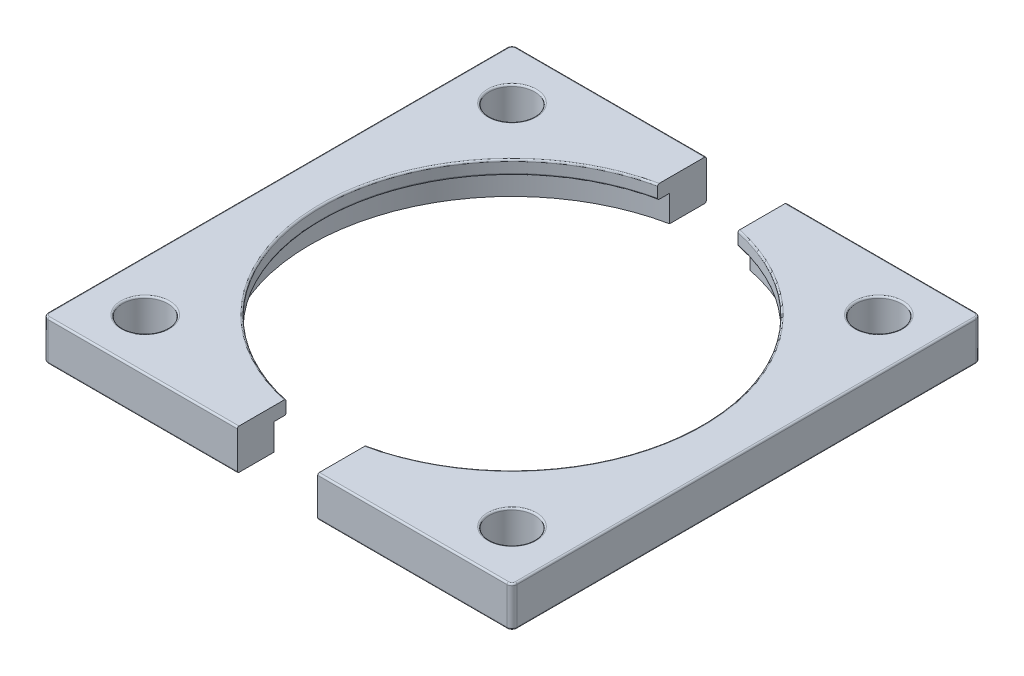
ISO-10303-21;
HEADER;
FILE_DESCRIPTION(('STEP AP214'),'2;1');
FILE_NAME('part.step','',(''),(''),'','','');
FILE_SCHEMA(('AUTOMOTIVE_DESIGN { 1 0 10303 214 1 1 1 1 }'));
ENDSEC;
DATA;
#1=APPLICATION_CONTEXT('core data for automotive mechanical design processes');
#2=APPLICATION_PROTOCOL_DEFINITION('international standard','automotive_design',2000,#1);
#3=PRODUCT_CONTEXT('',#1,'mechanical');
#4=PRODUCT('Part','Part','',(#3));
#5=PRODUCT_RELATED_PRODUCT_CATEGORY('part','',(#4));
#6=PRODUCT_DEFINITION_FORMATION('','',#4);
#7=PRODUCT_DEFINITION_CONTEXT('part definition',#1,'design');
#8=PRODUCT_DEFINITION('design','',#6,#7);
#9=PRODUCT_DEFINITION_SHAPE('','',#8);
#10=(LENGTH_UNIT() NAMED_UNIT(*) SI_UNIT(.MILLI.,.METRE.));
#11=(NAMED_UNIT(*) PLANE_ANGLE_UNIT() SI_UNIT($,.RADIAN.));
#12=(NAMED_UNIT(*) SI_UNIT($,.STERADIAN.) SOLID_ANGLE_UNIT());
#13=UNCERTAINTY_MEASURE_WITH_UNIT(LENGTH_MEASURE(1.E-05),#10,'distance_accuracy_value','');
#14=(GEOMETRIC_REPRESENTATION_CONTEXT(3) GLOBAL_UNCERTAINTY_ASSIGNED_CONTEXT((#13)) GLOBAL_UNIT_ASSIGNED_CONTEXT((#10,
#11,#12)) REPRESENTATION_CONTEXT('',''));
#15=CARTESIAN_POINT('',(0.,0.,0.));
#16=DIRECTION('',(0.,0.,1.));
#17=DIRECTION('',(1.,0.,0.));
#18=AXIS2_PLACEMENT_3D('',#15,#16,#17);
#19=CARTESIAN_POINT('',(0.,12.,0.));
#20=DIRECTION('',(0.,-1.,0.));
#21=DIRECTION('',(0.,0.,-1.));
#22=AXIS2_PLACEMENT_3D('',#19,#20,#21);
#23=CYLINDRICAL_SURFACE('',#22,56.75);
#24=DIRECTION('',(0.,-1.,0.));
#25=VECTOR('',#24,1.);
#26=CARTESIAN_POINT('',(12.,12.,55.4667693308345));
#27=LINE('',#26,#25);
#28=CARTESIAN_POINT('',(12.,11.5,55.4667693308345));
#29=VERTEX_POINT('',#28);
#30=CARTESIAN_POINT('',(12.,8.4,55.4667693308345));
#31=VERTEX_POINT('',#30);
#32=EDGE_CURVE('E222',#29,#31,#27,.T.);
#33=ORIENTED_EDGE('',*,*,#32,.F.);
#34=CARTESIAN_POINT('',(0.,11.5,0.));
#35=DIRECTION('',(0.,1.,0.));
#36=DIRECTION('',(0.,0.,1.));
#37=AXIS2_PLACEMENT_3D('',#34,#35,#36);
#38=CIRCLE('',#37,56.75);
#39=CARTESIAN_POINT('',(12.,11.5,-55.4667693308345));
#40=VERTEX_POINT('',#39);
#41=EDGE_CURVE('E375',#29,#40,#38,.T.);
#42=ORIENTED_EDGE('',*,*,#41,.T.);
#43=DIRECTION('',(0.,-1.,0.));
#44=VECTOR('',#43,1.);
#45=CARTESIAN_POINT('',(12.,12.,-55.4667693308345));
#46=LINE('',#45,#44);
#47=CARTESIAN_POINT('',(12.,8.4,-55.4667693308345));
#48=VERTEX_POINT('',#47);
#49=EDGE_CURVE('E224',#40,#48,#46,.T.);
#50=ORIENTED_EDGE('',*,*,#49,.T.);
#51=CARTESIAN_POINT('',(0.,8.4,0.));
#52=DIRECTION('',(0.,-1.,0.));
#53=DIRECTION('',(0.,0.,-1.));
#54=AXIS2_PLACEMENT_3D('',#51,#52,#53);
#55=CIRCLE('',#54,56.75);
#56=EDGE_CURVE('E59',#48,#31,#55,.T.);
#57=ORIENTED_EDGE('',*,*,#56,.T.);
#58=EDGE_LOOP('',(#33,#42,#50,#57));
#59=FACE_BOUND('',#58,.T.);
#60=ADVANCED_FACE('F42',(#59),#23,.F.);
#61=CARTESIAN_POINT('',(68.5,12.,68.5));
#62=DIRECTION('',(0.,1.,0.));
#63=DIRECTION('',(0.,0.,1.));
#64=AXIS2_PLACEMENT_3D('',#61,#62,#63);
#65=PLANE('',#64);
#66=DIRECTION('',(0.,0.,1.));
#67=VECTOR('',#66,1.);
#68=CARTESIAN_POINT('',(12.,12.,-55.4667693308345));
#69=LINE('',#68,#67);
#70=CARTESIAN_POINT('',(12.,12.,-69.5));
#71=VERTEX_POINT('',#70);
#72=CARTESIAN_POINT('',(12.,12.,-55.9782323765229));
#73=VERTEX_POINT('',#72);
#74=EDGE_CURVE('E209',#71,#73,#69,.T.);
#75=ORIENTED_EDGE('',*,*,#74,.T.);
#76=CARTESIAN_POINT('',(0.,12.,0.));
#77=DIRECTION('',(0.,1.,0.));
#78=DIRECTION('',(0.,0.,1.));
#79=AXIS2_PLACEMENT_3D('',#76,#77,#78);
#80=CIRCLE('',#79,57.25);
#81=CARTESIAN_POINT('',(12.,12.,55.9782323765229));
#82=VERTEX_POINT('',#81);
#83=EDGE_CURVE('E427',#73,#82,#80,.F.);
#84=ORIENTED_EDGE('',*,*,#83,.T.);
#85=DIRECTION('',(0.,0.,1.));
#86=VECTOR('',#85,1.);
#87=CARTESIAN_POINT('',(12.,12.,70.));
#88=LINE('',#87,#86);
#89=CARTESIAN_POINT('',(12.,12.,69.5));
#90=VERTEX_POINT('',#89);
#91=EDGE_CURVE('E212',#82,#90,#88,.T.);
#92=ORIENTED_EDGE('',*,*,#91,.T.);
#93=DIRECTION('',(1.,0.,0.));
#94=VECTOR('',#93,1.);
#95=CARTESIAN_POINT('',(68.5,12.,69.5));
#96=LINE('',#95,#94);
#97=CARTESIAN_POINT('',(68.5,12.,69.5));
#98=VERTEX_POINT('',#97);
#99=EDGE_CURVE('E419',#90,#98,#96,.T.);
#100=ORIENTED_EDGE('',*,*,#99,.T.);
#101=CARTESIAN_POINT('',(68.5,12.,68.5));
#102=DIRECTION('',(0.,1.,0.));
#103=DIRECTION('',(0.,0.,1.));
#104=AXIS2_PLACEMENT_3D('',#101,#102,#103);
#105=CIRCLE('',#104,1.);
#106=CARTESIAN_POINT('',(69.5,12.,68.5));
#107=VERTEX_POINT('',#106);
#108=EDGE_CURVE('E417',#98,#107,#105,.T.);
#109=ORIENTED_EDGE('',*,*,#108,.T.);
#110=DIRECTION('',(0.,0.,-1.));
#111=VECTOR('',#110,1.);
#112=CARTESIAN_POINT('',(69.5,12.,-68.5));
#113=LINE('',#112,#111);
#114=CARTESIAN_POINT('',(69.5,12.,-68.5));
#115=VERTEX_POINT('',#114);
#116=EDGE_CURVE('E421',#107,#115,#113,.T.);
#117=ORIENTED_EDGE('',*,*,#116,.T.);
#118=CARTESIAN_POINT('',(68.5,12.,-68.5));
#119=DIRECTION('',(0.,1.,0.));
#120=DIRECTION('',(0.,0.,1.));
#121=AXIS2_PLACEMENT_3D('',#118,#119,#120);
#122=CIRCLE('',#121,1.);
#123=CARTESIAN_POINT('',(68.5,12.,-69.5));
#124=VERTEX_POINT('',#123);
#125=EDGE_CURVE('E409',#115,#124,#122,.T.);
#126=ORIENTED_EDGE('',*,*,#125,.T.);
#127=DIRECTION('',(-1.,0.,0.));
#128=VECTOR('',#127,1.);
#129=CARTESIAN_POINT('',(12.,12.,-69.5));
#130=LINE('',#129,#128);
#131=EDGE_CURVE('E414',#124,#71,#130,.T.);
#132=ORIENTED_EDGE('',*,*,#131,.T.);
#133=EDGE_LOOP('',(#75,#84,#92,#100,#109,#117,#126,#132));
#134=FACE_BOUND('',#133,.T.);
#135=CARTESIAN_POINT('',(54.75,12.,54.75));
#136=DIRECTION('',(0.,1.,0.));
#137=DIRECTION('',(0.,0.,1.));
#138=AXIS2_PLACEMENT_3D('',#135,#136,#137);
#139=CIRCLE('',#138,7.25);
#140=CARTESIAN_POINT('',(54.75,12.,62.));
#141=VERTEX_POINT('',#140);
#142=EDGE_CURVE('E446',#141,#141,#139,.F.);
#143=ORIENTED_EDGE('',*,*,#142,.T.);
#144=EDGE_LOOP('',(#143));
#145=FACE_BOUND('',#144,.T.);
#146=CARTESIAN_POINT('',(54.75,12.,-54.75));
#147=DIRECTION('',(0.,1.,0.));
#148=DIRECTION('',(0.,0.,1.));
#149=AXIS2_PLACEMENT_3D('',#146,#147,#148);
#150=CIRCLE('',#149,7.25);
#151=CARTESIAN_POINT('',(54.75,12.,-47.5));
#152=VERTEX_POINT('',#151);
#153=EDGE_CURVE('E453',#152,#152,#150,.F.);
#154=ORIENTED_EDGE('',*,*,#153,.T.);
#155=EDGE_LOOP('',(#154));
#156=FACE_BOUND('',#155,.T.);
#157=ADVANCED_FACE('F354',(#134,#145,#156),#65,.T.);
#158=CARTESIAN_POINT('',(68.5,0.,68.5));
#159=DIRECTION('',(0.,1.,0.));
#160=DIRECTION('',(0.,0.,1.));
#161=AXIS2_PLACEMENT_3D('',#158,#159,#160);
#162=PLANE('',#161);
#163=DIRECTION('',(0.,0.,1.));
#164=VECTOR('',#163,1.);
#165=CARTESIAN_POINT('',(12.,0.,-55.4667693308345));
#166=LINE('',#165,#164);
#167=CARTESIAN_POINT('',(12.,0.,-69.5));
#168=VERTEX_POINT('',#167);
#169=CARTESIAN_POINT('',(12.,0.,-59.0428869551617));
#170=VERTEX_POINT('',#169);
#171=EDGE_CURVE('E170',#168,#170,#166,.T.);
#172=ORIENTED_EDGE('',*,*,#171,.F.);
#173=DIRECTION('',(-1.,0.,0.));
#174=VECTOR('',#173,1.);
#175=CARTESIAN_POINT('',(68.5,0.,-69.5));
#176=LINE('',#175,#174);
#177=CARTESIAN_POINT('',(68.5,0.,-69.5));
#178=VERTEX_POINT('',#177);
#179=EDGE_CURVE('E648',#168,#178,#176,.F.);
#180=ORIENTED_EDGE('',*,*,#179,.T.);
#181=CARTESIAN_POINT('',(68.5,0.,-68.5));
#182=DIRECTION('',(0.,1.,0.));
#183=DIRECTION('',(0.,0.,1.));
#184=AXIS2_PLACEMENT_3D('',#181,#182,#183);
#185=CIRCLE('',#184,1.);
#186=CARTESIAN_POINT('',(69.5,0.,-68.5));
#187=VERTEX_POINT('',#186);
#188=EDGE_CURVE('E650',#178,#187,#185,.F.);
#189=ORIENTED_EDGE('',*,*,#188,.T.);
#190=DIRECTION('',(0.,0.,-1.));
#191=VECTOR('',#190,1.);
#192=CARTESIAN_POINT('',(69.5,0.,68.5));
#193=LINE('',#192,#191);
#194=CARTESIAN_POINT('',(69.5,0.,68.5));
#195=VERTEX_POINT('',#194);
#196=EDGE_CURVE('E652',#187,#195,#193,.F.);
#197=ORIENTED_EDGE('',*,*,#196,.T.);
#198=CARTESIAN_POINT('',(68.5,0.,68.5));
#199=DIRECTION('',(0.,1.,0.));
#200=DIRECTION('',(0.,0.,1.));
#201=AXIS2_PLACEMENT_3D('',#198,#199,#200);
#202=CIRCLE('',#201,1.);
#203=CARTESIAN_POINT('',(68.5,0.,69.5));
#204=VERTEX_POINT('',#203);
#205=EDGE_CURVE('E654',#195,#204,#202,.F.);
#206=ORIENTED_EDGE('',*,*,#205,.T.);
#207=DIRECTION('',(1.,0.,0.));
#208=VECTOR('',#207,1.);
#209=CARTESIAN_POINT('',(68.5,0.,69.5));
#210=LINE('',#209,#208);
#211=CARTESIAN_POINT('',(12.,0.,69.5));
#212=VERTEX_POINT('',#211);
#213=EDGE_CURVE('E656',#204,#212,#210,.F.);
#214=ORIENTED_EDGE('',*,*,#213,.T.);
#215=DIRECTION('',(0.,0.,1.));
#216=VECTOR('',#215,1.);
#217=CARTESIAN_POINT('',(12.,0.,70.));
#218=LINE('',#217,#216);
#219=CARTESIAN_POINT('',(12.,0.,59.0428869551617));
#220=VERTEX_POINT('',#219);
#221=EDGE_CURVE('E180',#220,#212,#218,.T.);
#222=ORIENTED_EDGE('',*,*,#221,.F.);
#223=CARTESIAN_POINT('',(0.,0.,0.));
#224=DIRECTION('',(0.,-1.,0.));
#225=DIRECTION('',(0.,0.,-1.));
#226=AXIS2_PLACEMENT_3D('',#223,#224,#225);
#227=CIRCLE('',#226,60.25);
#228=EDGE_CURVE('E187',#170,#220,#227,.T.);
#229=ORIENTED_EDGE('',*,*,#228,.F.);
#230=EDGE_LOOP('',(#172,#180,#189,#197,#206,#214,#222,#229));
#231=FACE_BOUND('',#230,.T.);
#232=CARTESIAN_POINT('',(54.75,0.,-54.75));
#233=DIRECTION('',(0.,1.,0.));
#234=DIRECTION('',(0.,0.,-1.));
#235=AXIS2_PLACEMENT_3D('',#232,#233,#234);
#236=CIRCLE('',#235,6.75);
#237=CARTESIAN_POINT('',(54.75,0.,-61.5));
#238=VERTEX_POINT('',#237);
#239=EDGE_CURVE('E181',#238,#238,#236,.T.);
#240=ORIENTED_EDGE('',*,*,#239,.T.);
#241=EDGE_LOOP('',(#240));
#242=FACE_BOUND('',#241,.T.);
#243=CARTESIAN_POINT('',(54.75,0.,54.75));
#244=DIRECTION('',(0.,1.,0.));
#245=DIRECTION('',(0.,0.,1.));
#246=AXIS2_PLACEMENT_3D('',#243,#244,#245);
#247=CIRCLE('',#246,6.75);
#248=CARTESIAN_POINT('',(54.75,0.,61.5));
#249=VERTEX_POINT('',#248);
#250=EDGE_CURVE('E190',#249,#249,#247,.T.);
#251=ORIENTED_EDGE('',*,*,#250,.T.);
#252=EDGE_LOOP('',(#251));
#253=FACE_BOUND('',#252,.T.);
#254=ADVANCED_FACE('F194',(#231,#242,#253),#162,.F.);
#255=CARTESIAN_POINT('',(68.5,12.,68.5));
#256=DIRECTION('',(0.,-1.,0.));
#257=DIRECTION('',(0.,0.,-1.));
#258=AXIS2_PLACEMENT_3D('',#255,#256,#257);
#259=CYLINDRICAL_SURFACE('',#258,1.5);
#260=DIRECTION('',(0.,-1.,0.));
#261=VECTOR('',#260,1.);
#262=CARTESIAN_POINT('',(68.5,12.,70.));
#263=LINE('',#262,#261);
#264=CARTESIAN_POINT('',(68.5,11.5,70.));
#265=VERTEX_POINT('',#264);
#266=CARTESIAN_POINT('',(68.5,0.5,70.));
#267=VERTEX_POINT('',#266);
#268=EDGE_CURVE('E214',#265,#267,#263,.T.);
#269=ORIENTED_EDGE('',*,*,#268,.T.);
#270=CARTESIAN_POINT('',(68.5,0.5,68.5));
#271=DIRECTION('',(0.,1.,0.));
#272=DIRECTION('',(0.,0.,1.));
#273=AXIS2_PLACEMENT_3D('',#270,#271,#272);
#274=CIRCLE('',#273,1.5);
#275=CARTESIAN_POINT('',(70.,0.5,68.5));
#276=VERTEX_POINT('',#275);
#277=EDGE_CURVE('E450',#267,#276,#274,.T.);
#278=ORIENTED_EDGE('',*,*,#277,.T.);
#279=DIRECTION('',(0.,-1.,0.));
#280=VECTOR('',#279,1.);
#281=CARTESIAN_POINT('',(70.,12.,68.5));
#282=LINE('',#281,#280);
#283=CARTESIAN_POINT('',(70.,11.5,68.5));
#284=VERTEX_POINT('',#283);
#285=EDGE_CURVE('E234',#284,#276,#282,.T.);
#286=ORIENTED_EDGE('',*,*,#285,.F.);
#287=CARTESIAN_POINT('',(68.5,11.5,68.5));
#288=DIRECTION('',(0.,1.,0.));
#289=DIRECTION('',(0.,0.,1.));
#290=AXIS2_PLACEMENT_3D('',#287,#288,#289);
#291=CIRCLE('',#290,1.5);
#292=EDGE_CURVE('E447',#284,#265,#291,.F.);
#293=ORIENTED_EDGE('',*,*,#292,.T.);
#294=EDGE_LOOP('',(#269,#278,#286,#293));
#295=FACE_BOUND('',#294,.T.);
#296=ADVANCED_FACE('F280',(#295),#259,.T.);
#297=CARTESIAN_POINT('',(70.,12.,-68.5));
#298=DIRECTION('',(-1.,0.,0.));
#299=DIRECTION('',(0.,0.,1.));
#300=AXIS2_PLACEMENT_3D('',#297,#298,#299);
#301=PLANE('',#300);
#302=ORIENTED_EDGE('',*,*,#285,.T.);
#303=DIRECTION('',(0.,0.,-1.));
#304=VECTOR('',#303,1.);
#305=CARTESIAN_POINT('',(70.,0.5,-68.5));
#306=LINE('',#305,#304);
#307=CARTESIAN_POINT('',(70.,0.5,-68.5));
#308=VERTEX_POINT('',#307);
#309=EDGE_CURVE('E451',#276,#308,#306,.T.);
#310=ORIENTED_EDGE('',*,*,#309,.T.);
#311=DIRECTION('',(0.,-1.,0.));
#312=VECTOR('',#311,1.);
#313=CARTESIAN_POINT('',(70.,12.,-68.5));
#314=LINE('',#313,#312);
#315=CARTESIAN_POINT('',(70.,11.5,-68.5));
#316=VERTEX_POINT('',#315);
#317=EDGE_CURVE('E231',#316,#308,#314,.T.);
#318=ORIENTED_EDGE('',*,*,#317,.F.);
#319=DIRECTION('',(0.,0.,-1.));
#320=VECTOR('',#319,1.);
#321=CARTESIAN_POINT('',(70.,11.5,68.5));
#322=LINE('',#321,#320);
#323=EDGE_CURVE('E455',#316,#284,#322,.F.);
#324=ORIENTED_EDGE('',*,*,#323,.T.);
#325=EDGE_LOOP('',(#302,#310,#318,#324));
#326=FACE_BOUND('',#325,.T.);
#327=ADVANCED_FACE('F276',(#326),#301,.F.);
#328=CARTESIAN_POINT('',(68.5,12.,-68.5));
#329=DIRECTION('',(0.,-1.,0.));
#330=DIRECTION('',(0.,0.,-1.));
#331=AXIS2_PLACEMENT_3D('',#328,#329,#330);
#332=CYLINDRICAL_SURFACE('',#331,1.5);
#333=ORIENTED_EDGE('',*,*,#317,.T.);
#334=CARTESIAN_POINT('',(68.5,0.5,-68.5));
#335=DIRECTION('',(0.,1.,0.));
#336=DIRECTION('',(0.,0.,1.));
#337=AXIS2_PLACEMENT_3D('',#334,#335,#336);
#338=CIRCLE('',#337,1.5);
#339=CARTESIAN_POINT('',(68.5,0.5,-70.));
#340=VERTEX_POINT('',#339);
#341=EDGE_CURVE('E645',#308,#340,#338,.T.);
#342=ORIENTED_EDGE('',*,*,#341,.T.);
#343=DIRECTION('',(0.,-1.,0.));
#344=VECTOR('',#343,1.);
#345=CARTESIAN_POINT('',(68.5,12.,-70.));
#346=LINE('',#345,#344);
#347=CARTESIAN_POINT('',(68.5,11.5,-70.));
#348=VERTEX_POINT('',#347);
#349=EDGE_CURVE('E228',#348,#340,#346,.T.);
#350=ORIENTED_EDGE('',*,*,#349,.F.);
#351=CARTESIAN_POINT('',(68.5,11.5,-68.5));
#352=DIRECTION('',(0.,1.,0.));
#353=DIRECTION('',(0.,0.,1.));
#354=AXIS2_PLACEMENT_3D('',#351,#352,#353);
#355=CIRCLE('',#354,1.5);
#356=EDGE_CURVE('E410',#348,#316,#355,.F.);
#357=ORIENTED_EDGE('',*,*,#356,.T.);
#358=EDGE_LOOP('',(#333,#342,#350,#357));
#359=FACE_BOUND('',#358,.T.);
#360=ADVANCED_FACE('F272',(#359),#332,.T.);
#361=CARTESIAN_POINT('',(12.,12.,-70.));
#362=DIRECTION('',(0.,0.,1.));
#363=DIRECTION('',(1.,0.,0.));
#364=AXIS2_PLACEMENT_3D('',#361,#362,#363);
#365=PLANE('',#364);
#366=ORIENTED_EDGE('',*,*,#349,.T.);
#367=DIRECTION('',(-1.,0.,0.));
#368=VECTOR('',#367,1.);
#369=CARTESIAN_POINT('',(12.,0.5,-70.));
#370=LINE('',#369,#368);
#371=CARTESIAN_POINT('',(12.,0.5,-70.));
#372=VERTEX_POINT('',#371);
#373=EDGE_CURVE('E244',#340,#372,#370,.T.);
#374=ORIENTED_EDGE('',*,*,#373,.T.);
#375=DIRECTION('',(0.,-1.,0.));
#376=VECTOR('',#375,1.);
#377=CARTESIAN_POINT('',(12.,12.,-70.));
#378=LINE('',#377,#376);
#379=CARTESIAN_POINT('',(12.,11.5,-70.));
#380=VERTEX_POINT('',#379);
#381=EDGE_CURVE('E226',#380,#372,#378,.T.);
#382=ORIENTED_EDGE('',*,*,#381,.F.);
#383=DIRECTION('',(-1.,0.,0.));
#384=VECTOR('',#383,1.);
#385=CARTESIAN_POINT('',(68.5,11.5,-70.));
#386=LINE('',#385,#384);
#387=EDGE_CURVE('E242',#380,#348,#386,.F.);
#388=ORIENTED_EDGE('',*,*,#387,.T.);
#389=EDGE_LOOP('',(#366,#374,#382,#388));
#390=FACE_BOUND('',#389,.T.);
#391=ADVANCED_FACE('F267',(#390),#365,.F.);
#392=CARTESIAN_POINT('',(12.,12.,-55.4667693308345));
#393=DIRECTION('',(1.,0.,0.));
#394=DIRECTION('',(0.,0.,-1.));
#395=AXIS2_PLACEMENT_3D('',#392,#393,#394);
#396=PLANE('',#395);
#397=ORIENTED_EDGE('',*,*,#381,.T.);
#398=CARTESIAN_POINT('',(12.,0.5,-69.5));
#399=DIRECTION('',(1.,0.,0.));
#400=DIRECTION('',(0.,0.,-1.));
#401=AXIS2_PLACEMENT_3D('',#398,#399,#400);
#402=CIRCLE('',#401,0.5);
#403=EDGE_CURVE('E176',#372,#168,#402,.F.);
#404=ORIENTED_EDGE('',*,*,#403,.T.);
#405=ORIENTED_EDGE('',*,*,#171,.T.);
#406=DIRECTION('',(0.,-1.,0.));
#407=VECTOR('',#406,1.);
#408=CARTESIAN_POINT('',(12.,7.9,-59.0428869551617));
#409=LINE('',#408,#407);
#410=CARTESIAN_POINT('',(12.,7.9,-59.0428869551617));
#411=VERTEX_POINT('',#410);
#412=EDGE_CURVE('E175',#170,#411,#409,.F.);
#413=ORIENTED_EDGE('',*,*,#412,.T.);
#414=DIRECTION('',(0.,0.,-1.));
#415=VECTOR('',#414,1.);
#416=CARTESIAN_POINT('',(12.,7.9,-55.4667693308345));
#417=LINE('',#416,#415);
#418=CARTESIAN_POINT('',(12.,7.9,-55.9782323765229));
#419=VERTEX_POINT('',#418);
#420=EDGE_CURVE('E191',#419,#411,#417,.T.);
#421=ORIENTED_EDGE('',*,*,#420,.F.);
#422=CARTESIAN_POINT('',(12.,7.9,-55.9782323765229));
#423=CARTESIAN_POINT('',(12.,7.89997839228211,-55.9489743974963));
#424=CARTESIAN_POINT('',(12.,7.90245408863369,-55.9197199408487));
#425=CARTESIAN_POINT('',(12.,7.91224409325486,-55.8620353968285));
#426=CARTESIAN_POINT('',(12.,7.91955780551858,-55.833605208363));
#427=CARTESIAN_POINT('',(12.,7.93887463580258,-55.7783597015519));
#428=CARTESIAN_POINT('',(12.,7.95088101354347,-55.7515455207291));
#429=CARTESIAN_POINT('',(12.,7.97926610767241,-55.7003503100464));
#430=CARTESIAN_POINT('',(12.,7.99564325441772,-55.6759684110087));
#431=CARTESIAN_POINT('',(12.,8.0321468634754,-55.6306105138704));
#432=CARTESIAN_POINT('',(12.,8.0522325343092,-55.6096017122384));
#433=CARTESIAN_POINT('',(12.,8.09572095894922,-55.5713402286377));
#434=CARTESIAN_POINT('',(12.,8.11912418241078,-55.5540880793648));
#435=CARTESIAN_POINT('',(12.,8.16803931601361,-55.5242337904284));
#436=CARTESIAN_POINT('',(12.,8.19349540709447,-55.5115400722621));
#437=CARTESIAN_POINT('',(12.,8.2461995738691,-55.4907169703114));
#438=CARTESIAN_POINT('',(12.,8.27344597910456,-55.4825833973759));
#439=CARTESIAN_POINT('',(12.,8.3174275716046,-55.473507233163));
#440=CARTESIAN_POINT('',(12.,8.3338519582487,-55.4709819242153));
#441=CARTESIAN_POINT('',(12.,8.36684825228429,-55.4676135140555));
#442=CARTESIAN_POINT('',(12.,8.38341991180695,-55.4667679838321));
#443=CARTESIAN_POINT('',(12.,8.39999999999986,-55.4667693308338));
#444=B_SPLINE_CURVE_WITH_KNOTS('',3,(#422,#423,#424,#425,#426,#427,#428,#429,#430,#431,#432,
#433,#434,#435,#436,#437,#438,#439,#440,#441,#442,#443),.UNSPECIFIED.,.F.,.F.,(4,2,2,2,2,2,2,2,
2,2,4),(0.,0.0876650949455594,0.175319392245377,0.263034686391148,0.350718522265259,
0.437489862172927,0.524273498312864,0.609200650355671,0.694049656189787,0.743823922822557,
0.793526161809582),.UNSPECIFIED.);
#445=EDGE_CURVE('E247',#419,#48,#444,.T.);
#446=ORIENTED_EDGE('',*,*,#445,.T.);
#447=ORIENTED_EDGE('',*,*,#49,.F.);
#448=CARTESIAN_POINT('',(12.,11.5,-55.4667693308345));
#449=CARTESIAN_POINT('',(12.,11.5276706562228,-55.4667427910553));
#450=CARTESIAN_POINT('',(12.,11.5553303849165,-55.4691177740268));
#451=CARTESIAN_POINT('',(12.,11.6098215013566,-55.4784703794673));
#452=CARTESIAN_POINT('',(12.,11.6366540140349,-55.4854414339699));
#453=CARTESIAN_POINT('',(12.,11.6887741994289,-55.5037891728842));
#454=CARTESIAN_POINT('',(12.,11.7140614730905,-55.5151669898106));
#455=CARTESIAN_POINT('',(12.,11.7623919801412,-55.5419636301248));
#456=CARTESIAN_POINT('',(12.,11.7854352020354,-55.5573824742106));
#457=CARTESIAN_POINT('',(12.,11.8288835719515,-55.591968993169));
#458=CARTESIAN_POINT('',(12.,11.8492604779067,-55.6111721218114));
#459=CARTESIAN_POINT('',(12.,11.886586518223,-55.6526660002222));
#460=CARTESIAN_POINT('',(12.,11.9035348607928,-55.674957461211));
#461=CARTESIAN_POINT('',(12.,11.9339067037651,-55.722501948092));
#462=CARTESIAN_POINT('',(12.,11.9472465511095,-55.7478083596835));
#463=CARTESIAN_POINT('',(12.,11.9695805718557,-55.8002678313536));
#464=CARTESIAN_POINT('',(12.,11.9785759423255,-55.8274203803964));
#465=CARTESIAN_POINT('',(12.,11.9901795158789,-55.8752609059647));
#466=CARTESIAN_POINT('',(12.,11.9938599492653,-55.8956959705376));
#467=CARTESIAN_POINT('',(12.,11.9987701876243,-55.9368292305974));
#468=CARTESIAN_POINT('',(12.,12.0000034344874,-55.9575270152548));
#469=CARTESIAN_POINT('',(12.,12.,-55.9782323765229));
#470=B_SPLINE_CURVE_WITH_KNOTS('',3,(#448,#449,#450,#451,#452,#453,#454,#455,#456,#457,#458,
#459,#460,#461,#462,#463,#464,#465,#466,#467,#468,#469),.UNSPECIFIED.,.F.,.F.,(4,2,2,2,2,2,2,2,
2,2,4),(0.,0.082893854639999,0.165669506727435,0.248466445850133,0.331263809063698,
0.414877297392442,0.49851007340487,0.583941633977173,0.669349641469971,0.731501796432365,
0.793566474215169),.UNSPECIFIED.);
#471=EDGE_CURVE('E254',#40,#73,#470,.T.);
#472=ORIENTED_EDGE('',*,*,#471,.T.);
#473=ORIENTED_EDGE('',*,*,#74,.F.);
#474=CARTESIAN_POINT('',(12.,11.5,-69.5));
#475=DIRECTION('',(1.,0.,0.));
#476=DIRECTION('',(0.,0.,-1.));
#477=AXIS2_PLACEMENT_3D('',#474,#475,#476);
#478=CIRCLE('',#477,0.5);
#479=EDGE_CURVE('E415',#71,#380,#478,.F.);
#480=ORIENTED_EDGE('',*,*,#479,.T.);
#481=EDGE_LOOP('',(#397,#404,#405,#413,#421,#446,#447,#472,#473,#480));
#482=FACE_BOUND('',#481,.T.);
#483=ADVANCED_FACE('F173',(#482),#396,.F.);
#484=CARTESIAN_POINT('',(12.,12.,70.));
#485=DIRECTION('',(1.,0.,0.));
#486=DIRECTION('',(0.,0.,-1.));
#487=AXIS2_PLACEMENT_3D('',#484,#485,#486);
#488=PLANE('',#487);
#489=DIRECTION('',(0.,-1.,0.));
#490=VECTOR('',#489,1.);
#491=CARTESIAN_POINT('',(12.,12.,70.));
#492=LINE('',#491,#490);
#493=CARTESIAN_POINT('',(12.,11.5,70.));
#494=VERTEX_POINT('',#493);
#495=CARTESIAN_POINT('',(12.,0.5,70.));
#496=VERTEX_POINT('',#495);
#497=EDGE_CURVE('E219',#494,#496,#492,.T.);
#498=ORIENTED_EDGE('',*,*,#497,.F.);
#499=CARTESIAN_POINT('',(12.,11.5,69.5));
#500=DIRECTION('',(1.,0.,0.));
#501=DIRECTION('',(0.,0.,-1.));
#502=AXIS2_PLACEMENT_3D('',#499,#500,#501);
#503=CIRCLE('',#502,0.5);
#504=EDGE_CURVE('E336',#494,#90,#503,.F.);
#505=ORIENTED_EDGE('',*,*,#504,.T.);
#506=ORIENTED_EDGE('',*,*,#91,.F.);
#507=CARTESIAN_POINT('',(12.,12.,55.9782323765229));
#508=CARTESIAN_POINT('',(12.,12.0000216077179,55.9489743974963));
#509=CARTESIAN_POINT('',(12.,11.9975459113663,55.9197199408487));
#510=CARTESIAN_POINT('',(12.,11.9877559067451,55.8620353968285));
#511=CARTESIAN_POINT('',(12.,11.9804421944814,55.833605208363));
#512=CARTESIAN_POINT('',(12.,11.9611253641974,55.7783597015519));
#513=CARTESIAN_POINT('',(12.,11.9491189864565,55.7515455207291));
#514=CARTESIAN_POINT('',(12.,11.9207338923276,55.7003503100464));
#515=CARTESIAN_POINT('',(12.,11.9043567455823,55.6759684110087));
#516=CARTESIAN_POINT('',(12.,11.8678531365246,55.6306105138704));
#517=CARTESIAN_POINT('',(12.,11.8477674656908,55.6096017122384));
#518=CARTESIAN_POINT('',(12.,11.8042790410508,55.5713402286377));
#519=CARTESIAN_POINT('',(12.,11.7808758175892,55.5540880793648));
#520=CARTESIAN_POINT('',(12.,11.7319606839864,55.5242337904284));
#521=CARTESIAN_POINT('',(12.,11.7065045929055,55.5115400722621));
#522=CARTESIAN_POINT('',(12.,11.6538004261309,55.4907169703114));
#523=CARTESIAN_POINT('',(12.,11.6265540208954,55.4825833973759));
#524=CARTESIAN_POINT('',(12.,11.5825724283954,55.473507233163));
#525=CARTESIAN_POINT('',(12.,11.5661480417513,55.4709819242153));
#526=CARTESIAN_POINT('',(12.,11.5331517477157,55.4676135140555));
#527=CARTESIAN_POINT('',(12.,11.5165800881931,55.4667679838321));
#528=CARTESIAN_POINT('',(12.,11.5000000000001,55.4667693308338));
#529=B_SPLINE_CURVE_WITH_KNOTS('',3,(#507,#508,#509,#510,#511,#512,#513,#514,#515,#516,#517,
#518,#519,#520,#521,#522,#523,#524,#525,#526,#527,#528),.UNSPECIFIED.,.F.,.F.,(4,2,2,2,2,2,2,2,
2,2,4),(0.,0.0876650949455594,0.175319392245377,0.263034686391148,0.350718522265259,
0.437489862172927,0.524273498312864,0.609200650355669,0.694049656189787,0.743823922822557,
0.793526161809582),.UNSPECIFIED.);
#530=EDGE_CURVE('E66',#82,#29,#529,.T.);
#531=ORIENTED_EDGE('',*,*,#530,.T.);
#532=ORIENTED_EDGE('',*,*,#32,.T.);
#533=CARTESIAN_POINT('',(12.,8.4,55.4667693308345));
#534=CARTESIAN_POINT('',(12.,8.37232934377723,55.4667427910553));
#535=CARTESIAN_POINT('',(12.,8.34466961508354,55.4691177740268));
#536=CARTESIAN_POINT('',(12.,8.29017849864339,55.4784703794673));
#537=CARTESIAN_POINT('',(12.,8.26334598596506,55.4854414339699));
#538=CARTESIAN_POINT('',(12.,8.21122580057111,55.5037891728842));
#539=CARTESIAN_POINT('',(12.,8.18593852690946,55.5151669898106));
#540=CARTESIAN_POINT('',(12.,8.13760801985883,55.5419636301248));
#541=CARTESIAN_POINT('',(12.,8.11456479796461,55.5573824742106));
#542=CARTESIAN_POINT('',(12.,8.07111642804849,55.591968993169));
#543=CARTESIAN_POINT('',(12.,8.0507395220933,55.6111721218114));
#544=CARTESIAN_POINT('',(12.,8.01341348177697,55.6526660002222));
#545=CARTESIAN_POINT('',(12.,7.99646513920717,55.674957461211));
#546=CARTESIAN_POINT('',(12.,7.96609329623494,55.722501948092));
#547=CARTESIAN_POINT('',(12.,7.95275344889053,55.7478083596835));
#548=CARTESIAN_POINT('',(12.,7.93041942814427,55.8002678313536));
#549=CARTESIAN_POINT('',(12.,7.92142405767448,55.8274203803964));
#550=CARTESIAN_POINT('',(12.,7.90982048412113,55.8752609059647));
#551=CARTESIAN_POINT('',(12.,7.90614005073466,55.8956959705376));
#552=CARTESIAN_POINT('',(12.,7.90122981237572,55.9368292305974));
#553=CARTESIAN_POINT('',(12.,7.89999656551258,55.9575270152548));
#554=CARTESIAN_POINT('',(12.,7.9,55.9782323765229));
#555=B_SPLINE_CURVE_WITH_KNOTS('',3,(#533,#534,#535,#536,#537,#538,#539,#540,#541,#542,#543,
#544,#545,#546,#547,#548,#549,#550,#551,#552,#553,#554),.UNSPECIFIED.,.F.,.F.,(4,2,2,2,2,2,2,2,
2,2,4),(0.,0.082893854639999,0.165669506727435,0.248466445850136,0.331263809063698,
0.414877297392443,0.498510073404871,0.583941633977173,0.669349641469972,0.731501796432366,
0.79356647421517),.UNSPECIFIED.);
#556=CARTESIAN_POINT('',(12.,7.9,55.9782323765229));
#557=VERTEX_POINT('',#556);
#558=EDGE_CURVE('E337',#31,#557,#555,.T.);
#559=ORIENTED_EDGE('',*,*,#558,.T.);
#560=DIRECTION('',(0.,0.,-1.));
#561=VECTOR('',#560,1.);
#562=CARTESIAN_POINT('',(12.,7.9,70.));
#563=LINE('',#562,#561);
#564=CARTESIAN_POINT('',(12.,7.9,59.0428869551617));
#565=VERTEX_POINT('',#564);
#566=EDGE_CURVE('E237',#565,#557,#563,.T.);
#567=ORIENTED_EDGE('',*,*,#566,.F.);
#568=DIRECTION('',(0.,-1.,0.));
#569=VECTOR('',#568,1.);
#570=CARTESIAN_POINT('',(12.,7.9,59.0428869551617));
#571=LINE('',#570,#569);
#572=EDGE_CURVE('E240',#565,#220,#571,.T.);
#573=ORIENTED_EDGE('',*,*,#572,.T.);
#574=ORIENTED_EDGE('',*,*,#221,.T.);
#575=CARTESIAN_POINT('',(12.,0.5,69.5));
#576=DIRECTION('',(1.,0.,0.));
#577=DIRECTION('',(0.,0.,-1.));
#578=AXIS2_PLACEMENT_3D('',#575,#576,#577);
#579=CIRCLE('',#578,0.5);
#580=EDGE_CURVE('E432',#212,#496,#579,.F.);
#581=ORIENTED_EDGE('',*,*,#580,.T.);
#582=EDGE_LOOP('',(#498,#505,#506,#531,#532,#559,#567,#573,#574,#581));
#583=FACE_BOUND('',#582,.T.);
#584=ADVANCED_FACE('F266',(#583),#488,.F.);
#585=CARTESIAN_POINT('',(12.,12.,70.));
#586=DIRECTION('',(0.,0.,-1.));
#587=DIRECTION('',(-1.,0.,0.));
#588=AXIS2_PLACEMENT_3D('',#585,#586,#587);
#589=PLANE('',#588);
#590=ORIENTED_EDGE('',*,*,#268,.F.);
#591=DIRECTION('',(1.,0.,0.));
#592=VECTOR('',#591,1.);
#593=CARTESIAN_POINT('',(12.,11.5,70.));
#594=LINE('',#593,#592);
#595=EDGE_CURVE('E431',#265,#494,#594,.F.);
#596=ORIENTED_EDGE('',*,*,#595,.T.);
#597=ORIENTED_EDGE('',*,*,#497,.T.);
#598=DIRECTION('',(1.,0.,0.));
#599=VECTOR('',#598,1.);
#600=CARTESIAN_POINT('',(12.,0.5,70.));
#601=LINE('',#600,#599);
#602=EDGE_CURVE('E429',#496,#267,#601,.T.);
#603=ORIENTED_EDGE('',*,*,#602,.T.);
#604=EDGE_LOOP('',(#590,#596,#597,#603));
#605=FACE_BOUND('',#604,.T.);
#606=ADVANCED_FACE('F346',(#605),#589,.F.);
#607=CARTESIAN_POINT('',(54.75,12.,-54.75));
#608=DIRECTION('',(0.,-1.,0.));
#609=DIRECTION('',(0.,0.,-1.));
#610=AXIS2_PLACEMENT_3D('',#607,#608,#609);
#611=CYLINDRICAL_SURFACE('',#610,6.75);
#612=CARTESIAN_POINT('',(54.75,11.5,-54.75));
#613=DIRECTION('',(0.,1.,0.));
#614=DIRECTION('',(0.,0.,1.));
#615=AXIS2_PLACEMENT_3D('',#612,#613,#614);
#616=CIRCLE('',#615,6.75);
#617=CARTESIAN_POINT('',(54.75,11.5,-48.));
#618=VERTEX_POINT('',#617);
#619=EDGE_CURVE('E12',#618,#618,#616,.T.);
#620=ORIENTED_EDGE('',*,*,#619,.T.);
#621=EDGE_LOOP('',(#620));
#622=FACE_BOUND('',#621,.T.);
#623=ORIENTED_EDGE('',*,*,#239,.F.);
#624=EDGE_LOOP('',(#623));
#625=FACE_BOUND('',#624,.T.);
#626=ADVANCED_FACE('F350',(#622,#625),#611,.F.);
#627=CARTESIAN_POINT('',(54.75,12.,54.75));
#628=DIRECTION('',(0.,-1.,0.));
#629=DIRECTION('',(0.,0.,-1.));
#630=AXIS2_PLACEMENT_3D('',#627,#628,#629);
#631=CYLINDRICAL_SURFACE('',#630,6.75);
#632=CARTESIAN_POINT('',(54.75,11.5,54.75));
#633=DIRECTION('',(0.,1.,0.));
#634=DIRECTION('',(0.,0.,1.));
#635=AXIS2_PLACEMENT_3D('',#632,#633,#634);
#636=CIRCLE('',#635,6.75);
#637=CARTESIAN_POINT('',(54.75,11.5,61.5));
#638=VERTEX_POINT('',#637);
#639=EDGE_CURVE('E51',#638,#638,#636,.T.);
#640=ORIENTED_EDGE('',*,*,#639,.T.);
#641=EDGE_LOOP('',(#640));
#642=FACE_BOUND('',#641,.T.);
#643=ORIENTED_EDGE('',*,*,#250,.F.);
#644=EDGE_LOOP('',(#643));
#645=FACE_BOUND('',#644,.T.);
#646=ADVANCED_FACE('F360',(#642,#645),#631,.F.);
#647=CARTESIAN_POINT('',(0.,7.9,0.));
#648=DIRECTION('',(0.,-1.,0.));
#649=DIRECTION('',(0.,0.,-1.));
#650=AXIS2_PLACEMENT_3D('',#647,#648,#649);
#651=CYLINDRICAL_SURFACE('',#650,60.25);
#652=ORIENTED_EDGE('',*,*,#228,.T.);
#653=ORIENTED_EDGE('',*,*,#572,.F.);
#654=CARTESIAN_POINT('',(0.,7.9,0.));
#655=DIRECTION('',(0.,-1.,0.));
#656=DIRECTION('',(0.,0.,-1.));
#657=AXIS2_PLACEMENT_3D('',#654,#655,#656);
#658=CIRCLE('',#657,60.25);
#659=EDGE_CURVE('E189',#411,#565,#658,.T.);
#660=ORIENTED_EDGE('',*,*,#659,.F.);
#661=ORIENTED_EDGE('',*,*,#412,.F.);
#662=EDGE_LOOP('',(#652,#653,#660,#661));
#663=FACE_BOUND('',#662,.T.);
#664=ADVANCED_FACE('F185',(#663),#651,.F.);
#665=CARTESIAN_POINT('',(0.,7.9,0.));
#666=DIRECTION('',(0.,-1.,0.));
#667=DIRECTION('',(0.,0.,-1.));
#668=AXIS2_PLACEMENT_3D('',#665,#666,#667);
#669=PLANE('',#668);
#670=ORIENTED_EDGE('',*,*,#566,.T.);
#671=CARTESIAN_POINT('',(0.,7.9,0.));
#672=DIRECTION('',(0.,-1.,0.));
#673=DIRECTION('',(0.,0.,-1.));
#674=AXIS2_PLACEMENT_3D('',#671,#672,#673);
#675=CIRCLE('',#674,57.25);
#676=EDGE_CURVE('E381',#557,#419,#675,.F.);
#677=ORIENTED_EDGE('',*,*,#676,.T.);
#678=ORIENTED_EDGE('',*,*,#420,.T.);
#679=ORIENTED_EDGE('',*,*,#659,.T.);
#680=EDGE_LOOP('',(#670,#677,#678,#679));
#681=FACE_BOUND('',#680,.T.);
#682=ADVANCED_FACE('F305',(#681),#669,.T.);
#683=CARTESIAN_POINT('',(12.,0.5,69.5));
#684=DIRECTION('',(1.,0.,0.));
#685=DIRECTION('',(0.,0.,-1.));
#686=AXIS2_PLACEMENT_3D('',#683,#684,#685);
#687=CYLINDRICAL_SURFACE('',#686,0.5);
#688=ORIENTED_EDGE('',*,*,#580,.F.);
#689=ORIENTED_EDGE('',*,*,#213,.F.);
#690=CARTESIAN_POINT('',(68.5,0.5,69.5));
#691=DIRECTION('',(1.,0.,0.));
#692=DIRECTION('',(0.,0.,-1.));
#693=AXIS2_PLACEMENT_3D('',#690,#691,#692);
#694=CIRCLE('',#693,0.5);
#695=EDGE_CURVE('E197',#267,#204,#694,.T.);
#696=ORIENTED_EDGE('',*,*,#695,.F.);
#697=ORIENTED_EDGE('',*,*,#602,.F.);
#698=EDGE_LOOP('',(#688,#689,#696,#697));
#699=FACE_BOUND('',#698,.T.);
#700=ADVANCED_FACE('F301',(#699),#687,.T.);
#701=CARTESIAN_POINT('',(68.5,0.5,68.5));
#702=DIRECTION('',(0.,1.,0.));
#703=DIRECTION('',(0.,0.,1.));
#704=AXIS2_PLACEMENT_3D('',#701,#702,#703);
#705=TOROIDAL_SURFACE('',#704,1.,0.5);
#706=ORIENTED_EDGE('',*,*,#695,.T.);
#707=ORIENTED_EDGE('',*,*,#205,.F.);
#708=CARTESIAN_POINT('',(69.5,0.5,68.5));
#709=DIRECTION('',(0.,0.,-1.));
#710=DIRECTION('',(-1.,0.,0.));
#711=AXIS2_PLACEMENT_3D('',#708,#709,#710);
#712=CIRCLE('',#711,0.5);
#713=EDGE_CURVE('E201',#276,#195,#712,.T.);
#714=ORIENTED_EDGE('',*,*,#713,.F.);
#715=ORIENTED_EDGE('',*,*,#277,.F.);
#716=EDGE_LOOP('',(#706,#707,#714,#715));
#717=FACE_BOUND('',#716,.T.);
#718=ADVANCED_FACE('F297',(#717),#705,.T.);
#719=CARTESIAN_POINT('',(69.5,0.5,-68.5));
#720=DIRECTION('',(0.,0.,-1.));
#721=DIRECTION('',(-1.,0.,0.));
#722=AXIS2_PLACEMENT_3D('',#719,#720,#721);
#723=CYLINDRICAL_SURFACE('',#722,0.5);
#724=ORIENTED_EDGE('',*,*,#713,.T.);
#725=ORIENTED_EDGE('',*,*,#196,.F.);
#726=CARTESIAN_POINT('',(69.5,0.5,-68.5));
#727=DIRECTION('',(0.,0.,-1.));
#728=DIRECTION('',(-1.,0.,0.));
#729=AXIS2_PLACEMENT_3D('',#726,#727,#728);
#730=CIRCLE('',#729,0.5);
#731=EDGE_CURVE('E391',#308,#187,#730,.T.);
#732=ORIENTED_EDGE('',*,*,#731,.F.);
#733=ORIENTED_EDGE('',*,*,#309,.F.);
#734=EDGE_LOOP('',(#724,#725,#732,#733));
#735=FACE_BOUND('',#734,.T.);
#736=ADVANCED_FACE('F293',(#735),#723,.T.);
#737=CARTESIAN_POINT('',(68.5,0.5,-68.5));
#738=DIRECTION('',(0.,1.,0.));
#739=DIRECTION('',(0.,0.,1.));
#740=AXIS2_PLACEMENT_3D('',#737,#738,#739);
#741=TOROIDAL_SURFACE('',#740,1.,0.5);
#742=ORIENTED_EDGE('',*,*,#731,.T.);
#743=ORIENTED_EDGE('',*,*,#188,.F.);
#744=CARTESIAN_POINT('',(68.5,0.5,-69.5));
#745=DIRECTION('',(-1.,0.,0.));
#746=DIRECTION('',(0.,0.,1.));
#747=AXIS2_PLACEMENT_3D('',#744,#745,#746);
#748=CIRCLE('',#747,0.5);
#749=EDGE_CURVE('E388',#340,#178,#748,.T.);
#750=ORIENTED_EDGE('',*,*,#749,.F.);
#751=ORIENTED_EDGE('',*,*,#341,.F.);
#752=EDGE_LOOP('',(#742,#743,#750,#751));
#753=FACE_BOUND('',#752,.T.);
#754=ADVANCED_FACE('F289',(#753),#741,.T.);
#755=CARTESIAN_POINT('',(12.,0.5,-69.5));
#756=DIRECTION('',(-1.,0.,0.));
#757=DIRECTION('',(0.,0.,1.));
#758=AXIS2_PLACEMENT_3D('',#755,#756,#757);
#759=CYLINDRICAL_SURFACE('',#758,0.5);
#760=ORIENTED_EDGE('',*,*,#749,.T.);
#761=ORIENTED_EDGE('',*,*,#179,.F.);
#762=ORIENTED_EDGE('',*,*,#403,.F.);
#763=ORIENTED_EDGE('',*,*,#373,.F.);
#764=EDGE_LOOP('',(#760,#761,#762,#763));
#765=FACE_BOUND('',#764,.T.);
#766=ADVANCED_FACE('F285',(#765),#759,.T.);
#767=CARTESIAN_POINT('',(68.5,11.5,-69.5));
#768=DIRECTION('',(1.,0.,0.));
#769=DIRECTION('',(0.,0.,-1.));
#770=AXIS2_PLACEMENT_3D('',#767,#768,#769);
#771=CYLINDRICAL_SURFACE('',#770,0.5);
#772=ORIENTED_EDGE('',*,*,#479,.F.);
#773=ORIENTED_EDGE('',*,*,#131,.F.);
#774=CARTESIAN_POINT('',(68.5,11.5,-69.5));
#775=DIRECTION('',(1.,0.,0.));
#776=DIRECTION('',(0.,0.,-1.));
#777=AXIS2_PLACEMENT_3D('',#774,#775,#776);
#778=CIRCLE('',#777,0.5);
#779=EDGE_CURVE('E46',#348,#124,#778,.T.);
#780=ORIENTED_EDGE('',*,*,#779,.F.);
#781=ORIENTED_EDGE('',*,*,#387,.F.);
#782=EDGE_LOOP('',(#772,#773,#780,#781));
#783=FACE_BOUND('',#782,.T.);
#784=ADVANCED_FACE('F288',(#783),#771,.T.);
#785=CARTESIAN_POINT('',(68.5,11.5,-68.5));
#786=DIRECTION('',(0.,1.,0.));
#787=DIRECTION('',(0.,0.,1.));
#788=AXIS2_PLACEMENT_3D('',#785,#786,#787);
#789=TOROIDAL_SURFACE('',#788,1.,0.5);
#790=ORIENTED_EDGE('',*,*,#779,.T.);
#791=ORIENTED_EDGE('',*,*,#125,.F.);
#792=CARTESIAN_POINT('',(69.5,11.5,-68.5));
#793=DIRECTION('',(0.,0.,1.));
#794=DIRECTION('',(1.,0.,0.));
#795=AXIS2_PLACEMENT_3D('',#792,#793,#794);
#796=CIRCLE('',#795,0.5);
#797=EDGE_CURVE('E400',#316,#115,#796,.T.);
#798=ORIENTED_EDGE('',*,*,#797,.F.);
#799=ORIENTED_EDGE('',*,*,#356,.F.);
#800=EDGE_LOOP('',(#790,#791,#798,#799));
#801=FACE_BOUND('',#800,.T.);
#802=ADVANCED_FACE('F319',(#801),#789,.T.);
#803=CARTESIAN_POINT('',(69.5,11.5,68.5));
#804=DIRECTION('',(0.,0.,1.));
#805=DIRECTION('',(1.,0.,0.));
#806=AXIS2_PLACEMENT_3D('',#803,#804,#805);
#807=CYLINDRICAL_SURFACE('',#806,0.5);
#808=ORIENTED_EDGE('',*,*,#797,.T.);
#809=ORIENTED_EDGE('',*,*,#116,.F.);
#810=CARTESIAN_POINT('',(69.5,11.5,68.5));
#811=DIRECTION('',(0.,0.,1.));
#812=DIRECTION('',(1.,0.,0.));
#813=AXIS2_PLACEMENT_3D('',#810,#811,#812);
#814=CIRCLE('',#813,0.5);
#815=EDGE_CURVE('E398',#284,#107,#814,.T.);
#816=ORIENTED_EDGE('',*,*,#815,.F.);
#817=ORIENTED_EDGE('',*,*,#323,.F.);
#818=EDGE_LOOP('',(#808,#809,#816,#817));
#819=FACE_BOUND('',#818,.T.);
#820=ADVANCED_FACE('F315',(#819),#807,.T.);
#821=CARTESIAN_POINT('',(68.5,11.5,68.5));
#822=DIRECTION('',(0.,1.,0.));
#823=DIRECTION('',(0.,0.,1.));
#824=AXIS2_PLACEMENT_3D('',#821,#822,#823);
#825=TOROIDAL_SURFACE('',#824,1.,0.5);
#826=ORIENTED_EDGE('',*,*,#815,.T.);
#827=ORIENTED_EDGE('',*,*,#108,.F.);
#828=CARTESIAN_POINT('',(68.5,11.5,69.5));
#829=DIRECTION('',(-1.,0.,0.));
#830=DIRECTION('',(0.,0.,1.));
#831=AXIS2_PLACEMENT_3D('',#828,#829,#830);
#832=CIRCLE('',#831,0.5);
#833=EDGE_CURVE('E396',#265,#98,#832,.T.);
#834=ORIENTED_EDGE('',*,*,#833,.F.);
#835=ORIENTED_EDGE('',*,*,#292,.F.);
#836=EDGE_LOOP('',(#826,#827,#834,#835));
#837=FACE_BOUND('',#836,.T.);
#838=ADVANCED_FACE('F311',(#837),#825,.T.);
#839=CARTESIAN_POINT('',(68.5,11.5,69.5));
#840=DIRECTION('',(-1.,0.,0.));
#841=DIRECTION('',(0.,0.,1.));
#842=AXIS2_PLACEMENT_3D('',#839,#840,#841);
#843=CYLINDRICAL_SURFACE('',#842,0.5);
#844=ORIENTED_EDGE('',*,*,#504,.F.);
#845=ORIENTED_EDGE('',*,*,#595,.F.);
#846=ORIENTED_EDGE('',*,*,#833,.T.);
#847=ORIENTED_EDGE('',*,*,#99,.F.);
#848=EDGE_LOOP('',(#844,#845,#846,#847));
#849=FACE_BOUND('',#848,.T.);
#850=ADVANCED_FACE('F307',(#849),#843,.T.);
#851=CARTESIAN_POINT('',(0.,11.5,0.));
#852=DIRECTION('',(0.,1.,0.));
#853=DIRECTION('',(0.,0.,1.));
#854=AXIS2_PLACEMENT_3D('',#851,#852,#853);
#855=TOROIDAL_SURFACE('',#854,57.25,0.5);
#856=ORIENTED_EDGE('',*,*,#471,.F.);
#857=ORIENTED_EDGE('',*,*,#41,.F.);
#858=ORIENTED_EDGE('',*,*,#530,.F.);
#859=ORIENTED_EDGE('',*,*,#83,.F.);
#860=EDGE_LOOP('',(#856,#857,#858,#859));
#861=FACE_BOUND('',#860,.T.);
#862=ADVANCED_FACE('F310',(#861),#855,.T.);
#863=CARTESIAN_POINT('',(0.,8.4,0.));
#864=DIRECTION('',(0.,-1.,0.));
#865=DIRECTION('',(0.,0.,-1.));
#866=AXIS2_PLACEMENT_3D('',#863,#864,#865);
#867=TOROIDAL_SURFACE('',#866,57.25,0.5);
#868=ORIENTED_EDGE('',*,*,#558,.F.);
#869=ORIENTED_EDGE('',*,*,#56,.F.);
#870=ORIENTED_EDGE('',*,*,#445,.F.);
#871=ORIENTED_EDGE('',*,*,#676,.F.);
#872=EDGE_LOOP('',(#868,#869,#870,#871));
#873=FACE_BOUND('',#872,.T.);
#874=ADVANCED_FACE('F260',(#873),#867,.T.);
#875=CARTESIAN_POINT('',(54.75,11.5,54.75));
#876=DIRECTION('',(0.,1.,0.));
#877=DIRECTION('',(0.,0.,1.));
#878=AXIS2_PLACEMENT_3D('',#875,#876,#877);
#879=TOROIDAL_SURFACE('',#878,7.25,0.5);
#880=ORIENTED_EDGE('',*,*,#142,.F.);
#881=EDGE_LOOP('',(#880));
#882=FACE_BOUND('',#881,.T.);
#883=ORIENTED_EDGE('',*,*,#639,.F.);
#884=EDGE_LOOP('',(#883));
#885=FACE_BOUND('',#884,.T.);
#886=ADVANCED_FACE('F465',(#882,#885),#879,.T.);
#887=CARTESIAN_POINT('',(54.75,11.5,-54.75));
#888=DIRECTION('',(0.,1.,0.));
#889=DIRECTION('',(0.,0.,1.));
#890=AXIS2_PLACEMENT_3D('',#887,#888,#889);
#891=TOROIDAL_SURFACE('',#890,7.25,0.5);
#892=ORIENTED_EDGE('',*,*,#153,.F.);
#893=EDGE_LOOP('',(#892));
#894=FACE_BOUND('',#893,.T.);
#895=ORIENTED_EDGE('',*,*,#619,.F.);
#896=EDGE_LOOP('',(#895));
#897=FACE_BOUND('',#896,.T.);
#898=ADVANCED_FACE('F44',(#894,#897),#891,.T.);
#899=CLOSED_SHELL('',(#60,#157,#254,#296,#327,#360,#391,#483,#584,#606,#626,#646,#664,#682,#700,
#718,#736,#754,#766,#784,#802,#820,#838,#850,#862,#874,#886,#898));
#900=MANIFOLD_SOLID_BREP('B2',#899);
#901=CARTESIAN_POINT('',(0.,12.,0.));
#902=DIRECTION('',(0.,-1.,0.));
#903=DIRECTION('',(0.,0.,-1.));
#904=AXIS2_PLACEMENT_3D('',#901,#902,#903);
#905=CYLINDRICAL_SURFACE('',#904,56.75);
#906=DIRECTION('',(0.,-1.,0.));
#907=VECTOR('',#906,1.);
#908=CARTESIAN_POINT('',(-12.,12.,55.4667693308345));
#909=LINE('',#908,#907);
#910=CARTESIAN_POINT('',(-12.,11.5,55.4667693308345));
#911=VERTEX_POINT('',#910);
#912=CARTESIAN_POINT('',(-12.,8.4,55.4667693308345));
#913=VERTEX_POINT('',#912);
#914=EDGE_CURVE('E866',#911,#913,#909,.T.);
#915=ORIENTED_EDGE('',*,*,#914,.T.);
#916=CARTESIAN_POINT('',(0.,8.4,0.));
#917=DIRECTION('',(0.,-1.,0.));
#918=DIRECTION('',(0.,0.,-1.));
#919=AXIS2_PLACEMENT_3D('',#916,#917,#918);
#920=CIRCLE('',#919,56.75);
#921=CARTESIAN_POINT('',(-12.,8.4,-55.4667693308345));
#922=VERTEX_POINT('',#921);
#923=EDGE_CURVE('E1040',#913,#922,#920,.T.);
#924=ORIENTED_EDGE('',*,*,#923,.T.);
#925=DIRECTION('',(0.,-1.,0.));
#926=VECTOR('',#925,1.);
#927=CARTESIAN_POINT('',(-12.,12.,-55.4667693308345));
#928=LINE('',#927,#926);
#929=CARTESIAN_POINT('',(-12.,11.5,-55.4667693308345));
#930=VERTEX_POINT('',#929);
#931=EDGE_CURVE('E863',#930,#922,#928,.T.);
#932=ORIENTED_EDGE('',*,*,#931,.F.);
#933=CARTESIAN_POINT('',(0.,11.5,0.));
#934=DIRECTION('',(0.,1.,0.));
#935=DIRECTION('',(0.,0.,1.));
#936=AXIS2_PLACEMENT_3D('',#933,#934,#935);
#937=CIRCLE('',#936,56.75);
#938=EDGE_CURVE('E939',#930,#911,#937,.T.);
#939=ORIENTED_EDGE('',*,*,#938,.T.);
#940=EDGE_LOOP('',(#915,#924,#932,#939));
#941=FACE_BOUND('',#940,.T.);
#942=ADVANCED_FACE('F677',(#941),#905,.F.);
#943=CARTESIAN_POINT('',(-68.5,12.,68.5));
#944=DIRECTION('',(0.,1.,0.));
#945=DIRECTION('',(0.,0.,1.));
#946=AXIS2_PLACEMENT_3D('',#943,#944,#945);
#947=PLANE('',#946);
#948=CARTESIAN_POINT('',(-54.75,12.,54.75));
#949=DIRECTION('',(0.,1.,0.));
#950=DIRECTION('',(0.,0.,1.));
#951=AXIS2_PLACEMENT_3D('',#948,#949,#950);
#952=CIRCLE('',#951,7.25);
#953=CARTESIAN_POINT('',(-54.75,12.,62.));
#954=VERTEX_POINT('',#953);
#955=EDGE_CURVE('E1067',#954,#954,#952,.F.);
#956=ORIENTED_EDGE('',*,*,#955,.T.);
#957=EDGE_LOOP('',(#956));
#958=FACE_BOUND('',#957,.T.);
#959=CARTESIAN_POINT('',(-54.75,12.,-54.75));
#960=DIRECTION('',(0.,1.,0.));
#961=DIRECTION('',(0.,0.,1.));
#962=AXIS2_PLACEMENT_3D('',#959,#960,#961);
#963=CIRCLE('',#962,7.25);
#964=CARTESIAN_POINT('',(-54.75,12.,-47.5));
#965=VERTEX_POINT('',#964);
#966=EDGE_CURVE('E1008',#965,#965,#963,.F.);
#967=ORIENTED_EDGE('',*,*,#966,.T.);
#968=EDGE_LOOP('',(#967));
#969=FACE_BOUND('',#968,.T.);
#970=DIRECTION('',(0.,0.,-1.));
#971=VECTOR('',#970,1.);
#972=CARTESIAN_POINT('',(-12.,12.,55.4667693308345));
#973=LINE('',#972,#971);
#974=CARTESIAN_POINT('',(-12.,12.,69.5));
#975=VERTEX_POINT('',#974);
#976=CARTESIAN_POINT('',(-12.,12.,55.9782323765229));
#977=VERTEX_POINT('',#976);
#978=EDGE_CURVE('E844',#975,#977,#973,.T.);
#979=ORIENTED_EDGE('',*,*,#978,.T.);
#980=CARTESIAN_POINT('',(0.,12.,0.));
#981=DIRECTION('',(0.,1.,0.));
#982=DIRECTION('',(0.,0.,1.));
#983=AXIS2_PLACEMENT_3D('',#980,#981,#982);
#984=CIRCLE('',#983,57.25);
#985=CARTESIAN_POINT('',(-12.,12.,-55.978232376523));
#986=VERTEX_POINT('',#985);
#987=EDGE_CURVE('E1049',#977,#986,#984,.F.);
#988=ORIENTED_EDGE('',*,*,#987,.T.);
#989=DIRECTION('',(0.,0.,-1.));
#990=VECTOR('',#989,1.);
#991=CARTESIAN_POINT('',(-12.,12.,-70.));
#992=LINE('',#991,#990);
#993=CARTESIAN_POINT('',(-12.,12.,-69.5));
#994=VERTEX_POINT('',#993);
#995=EDGE_CURVE('E847',#986,#994,#992,.T.);
#996=ORIENTED_EDGE('',*,*,#995,.T.);
#997=DIRECTION('',(-1.,0.,0.));
#998=VECTOR('',#997,1.);
#999=CARTESIAN_POINT('',(-68.5,12.,-69.5));
#1000=LINE('',#999,#998);
#1001=CARTESIAN_POINT('',(-68.5,12.,-69.5));
#1002=VERTEX_POINT('',#1001);
#1003=EDGE_CURVE('E1056',#994,#1002,#1000,.T.);
#1004=ORIENTED_EDGE('',*,*,#1003,.T.);
#1005=CARTESIAN_POINT('',(-68.5,12.,-68.5));
#1006=DIRECTION('',(0.,1.,0.));
#1007=DIRECTION('',(0.,0.,1.));
#1008=AXIS2_PLACEMENT_3D('',#1005,#1006,#1007);
#1009=CIRCLE('',#1008,1.);
#1010=CARTESIAN_POINT('',(-69.5,12.,-68.5));
#1011=VERTEX_POINT('',#1010);
#1012=EDGE_CURVE('E1059',#1002,#1011,#1009,.T.);
#1013=ORIENTED_EDGE('',*,*,#1012,.T.);
#1014=DIRECTION('',(0.,0.,1.));
#1015=VECTOR('',#1014,1.);
#1016=CARTESIAN_POINT('',(-69.5,12.,68.5));
#1017=LINE('',#1016,#1015);
#1018=CARTESIAN_POINT('',(-69.5,12.,68.5));
#1019=VERTEX_POINT('',#1018);
#1020=EDGE_CURVE('E1061',#1011,#1019,#1017,.T.);
#1021=ORIENTED_EDGE('',*,*,#1020,.T.);
#1022=CARTESIAN_POINT('',(-68.5,12.,68.5));
#1023=DIRECTION('',(0.,1.,0.));
#1024=DIRECTION('',(0.,0.,1.));
#1025=AXIS2_PLACEMENT_3D('',#1022,#1023,#1024);
#1026=CIRCLE('',#1025,1.);
#1027=CARTESIAN_POINT('',(-68.5,12.,69.5));
#1028=VERTEX_POINT('',#1027);
#1029=EDGE_CURVE('E1063',#1019,#1028,#1026,.T.);
#1030=ORIENTED_EDGE('',*,*,#1029,.T.);
#1031=DIRECTION('',(1.,0.,0.));
#1032=VECTOR('',#1031,1.);
#1033=CARTESIAN_POINT('',(-12.,12.,69.5));
#1034=LINE('',#1033,#1032);
#1035=EDGE_CURVE('E1065',#1028,#975,#1034,.T.);
#1036=ORIENTED_EDGE('',*,*,#1035,.T.);
#1037=EDGE_LOOP('',(#979,#988,#996,#1004,#1013,#1021,#1030,#1036));
#1038=FACE_BOUND('',#1037,.T.);
#1039=ADVANCED_FACE('F919',(#958,#969,#1038),#947,.T.);
#1040=CARTESIAN_POINT('',(-68.5,0.,68.5));
#1041=DIRECTION('',(0.,1.,0.));
#1042=DIRECTION('',(0.,0.,1.));
#1043=AXIS2_PLACEMENT_3D('',#1040,#1041,#1042);
#1044=PLANE('',#1043);
#1045=CARTESIAN_POINT('',(-68.5,0.,-68.5));
#1046=DIRECTION('',(0.,1.,0.));
#1047=DIRECTION('',(0.,0.,1.));
#1048=AXIS2_PLACEMENT_3D('',#1045,#1046,#1047);
#1049=CIRCLE('',#1048,1.);
#1050=CARTESIAN_POINT('',(-69.5,0.,-68.5));
#1051=VERTEX_POINT('',#1050);
#1052=CARTESIAN_POINT('',(-68.5,0.,-69.5));
#1053=VERTEX_POINT('',#1052);
#1054=EDGE_CURVE('E889',#1051,#1053,#1049,.F.);
#1055=ORIENTED_EDGE('',*,*,#1054,.T.);
#1056=DIRECTION('',(-1.,0.,0.));
#1057=VECTOR('',#1056,1.);
#1058=CARTESIAN_POINT('',(-68.5,0.,-69.5));
#1059=LINE('',#1058,#1057);
#1060=CARTESIAN_POINT('',(-12.,0.,-69.5));
#1061=VERTEX_POINT('',#1060);
#1062=EDGE_CURVE('E891',#1053,#1061,#1059,.F.);
#1063=ORIENTED_EDGE('',*,*,#1062,.T.);
#1064=DIRECTION('',(0.,0.,-1.));
#1065=VECTOR('',#1064,1.);
#1066=CARTESIAN_POINT('',(-12.,0.,-70.));
#1067=LINE('',#1066,#1065);
#1068=CARTESIAN_POINT('',(-12.,0.,-59.0428869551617));
#1069=VERTEX_POINT('',#1068);
#1070=EDGE_CURVE('E815',#1069,#1061,#1067,.T.);
#1071=ORIENTED_EDGE('',*,*,#1070,.F.);
#1072=CARTESIAN_POINT('',(0.,0.,0.));
#1073=DIRECTION('',(0.,-1.,0.));
#1074=DIRECTION('',(0.,0.,-1.));
#1075=AXIS2_PLACEMENT_3D('',#1072,#1073,#1074);
#1076=CIRCLE('',#1075,60.25);
#1077=CARTESIAN_POINT('',(-12.,0.,59.0428869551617));
#1078=VERTEX_POINT('',#1077);
#1079=EDGE_CURVE('E822',#1078,#1069,#1076,.T.);
#1080=ORIENTED_EDGE('',*,*,#1079,.F.);
#1081=DIRECTION('',(0.,0.,-1.));
#1082=VECTOR('',#1081,1.);
#1083=CARTESIAN_POINT('',(-12.,0.,55.4667693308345));
#1084=LINE('',#1083,#1082);
#1085=CARTESIAN_POINT('',(-12.,0.,69.5));
#1086=VERTEX_POINT('',#1085);
#1087=EDGE_CURVE('E805',#1086,#1078,#1084,.T.);
#1088=ORIENTED_EDGE('',*,*,#1087,.F.);
#1089=DIRECTION('',(1.,0.,0.));
#1090=VECTOR('',#1089,1.);
#1091=CARTESIAN_POINT('',(-68.5,0.,69.5));
#1092=LINE('',#1091,#1090);
#1093=CARTESIAN_POINT('',(-68.5,0.,69.5));
#1094=VERTEX_POINT('',#1093);
#1095=EDGE_CURVE('E883',#1086,#1094,#1092,.F.);
#1096=ORIENTED_EDGE('',*,*,#1095,.T.);
#1097=CARTESIAN_POINT('',(-68.5,0.,68.5));
#1098=DIRECTION('',(0.,1.,0.));
#1099=DIRECTION('',(0.,0.,1.));
#1100=AXIS2_PLACEMENT_3D('',#1097,#1098,#1099);
#1101=CIRCLE('',#1100,1.);
#1102=CARTESIAN_POINT('',(-69.5,0.,68.5));
#1103=VERTEX_POINT('',#1102);
#1104=EDGE_CURVE('E885',#1094,#1103,#1101,.F.);
#1105=ORIENTED_EDGE('',*,*,#1104,.T.);
#1106=DIRECTION('',(0.,0.,1.));
#1107=VECTOR('',#1106,1.);
#1108=CARTESIAN_POINT('',(-69.5,0.,68.5));
#1109=LINE('',#1108,#1107);
#1110=EDGE_CURVE('E887',#1103,#1051,#1109,.F.);
#1111=ORIENTED_EDGE('',*,*,#1110,.T.);
#1112=EDGE_LOOP('',(#1055,#1063,#1071,#1080,#1088,#1096,#1105,#1111));
#1113=FACE_BOUND('',#1112,.T.);
#1114=CARTESIAN_POINT('',(-54.75,0.,-54.75));
#1115=DIRECTION('',(0.,1.,0.));
#1116=DIRECTION('',(0.,0.,1.));
#1117=AXIS2_PLACEMENT_3D('',#1114,#1115,#1116);
#1118=CIRCLE('',#1117,6.75);
#1119=CARTESIAN_POINT('',(-54.75,0.,-48.));
#1120=VERTEX_POINT('',#1119);
#1121=EDGE_CURVE('E816',#1120,#1120,#1118,.T.);
#1122=ORIENTED_EDGE('',*,*,#1121,.T.);
#1123=EDGE_LOOP('',(#1122));
#1124=FACE_BOUND('',#1123,.T.);
#1125=CARTESIAN_POINT('',(-54.75,0.,54.75));
#1126=DIRECTION('',(0.,1.,0.));
#1127=DIRECTION('',(0.,0.,-1.));
#1128=AXIS2_PLACEMENT_3D('',#1125,#1126,#1127);
#1129=CIRCLE('',#1128,6.75);
#1130=CARTESIAN_POINT('',(-54.75,0.,48.));
#1131=VERTEX_POINT('',#1130);
#1132=EDGE_CURVE('E825',#1131,#1131,#1129,.T.);
#1133=ORIENTED_EDGE('',*,*,#1132,.T.);
#1134=EDGE_LOOP('',(#1133));
#1135=FACE_BOUND('',#1134,.T.);
#1136=ADVANCED_FACE('F829',(#1113,#1124,#1135),#1044,.F.);
#1137=CARTESIAN_POINT('',(-68.5,12.,68.5));
#1138=DIRECTION('',(0.,-1.,0.));
#1139=DIRECTION('',(0.,0.,-1.));
#1140=AXIS2_PLACEMENT_3D('',#1137,#1138,#1139);
#1141=CYLINDRICAL_SURFACE('',#1140,1.5);
#1142=DIRECTION('',(0.,-1.,0.));
#1143=VECTOR('',#1142,1.);
#1144=CARTESIAN_POINT('',(-70.,12.,68.5));
#1145=LINE('',#1144,#1143);
#1146=CARTESIAN_POINT('',(-70.,11.5,68.5));
#1147=VERTEX_POINT('',#1146);
#1148=CARTESIAN_POINT('',(-70.,0.5,68.5));
#1149=VERTEX_POINT('',#1148);
#1150=EDGE_CURVE('E849',#1147,#1149,#1145,.T.);
#1151=ORIENTED_EDGE('',*,*,#1150,.T.);
#1152=CARTESIAN_POINT('',(-68.5,0.5,68.5));
#1153=DIRECTION('',(0.,1.,0.));
#1154=DIRECTION('',(0.,0.,1.));
#1155=AXIS2_PLACEMENT_3D('',#1152,#1153,#1154);
#1156=CIRCLE('',#1155,1.5);
#1157=CARTESIAN_POINT('',(-68.5,0.5,70.));
#1158=VERTEX_POINT('',#1157);
#1159=EDGE_CURVE('E998',#1149,#1158,#1156,.T.);
#1160=ORIENTED_EDGE('',*,*,#1159,.T.);
#1161=DIRECTION('',(0.,-1.,0.));
#1162=VECTOR('',#1161,1.);
#1163=CARTESIAN_POINT('',(-68.5,12.,70.));
#1164=LINE('',#1163,#1162);
#1165=CARTESIAN_POINT('',(-68.5,11.5,70.));
#1166=VERTEX_POINT('',#1165);
#1167=EDGE_CURVE('E871',#1166,#1158,#1164,.T.);
#1168=ORIENTED_EDGE('',*,*,#1167,.F.);
#1169=CARTESIAN_POINT('',(-68.5,11.5,68.5));
#1170=DIRECTION('',(0.,1.,0.));
#1171=DIRECTION('',(0.,0.,1.));
#1172=AXIS2_PLACEMENT_3D('',#1169,#1170,#1171);
#1173=CIRCLE('',#1172,1.5);
#1174=EDGE_CURVE('E1000',#1166,#1147,#1173,.F.);
#1175=ORIENTED_EDGE('',*,*,#1174,.T.);
#1176=EDGE_LOOP('',(#1151,#1160,#1168,#1175));
#1177=FACE_BOUND('',#1176,.T.);
#1178=ADVANCED_FACE('F987',(#1177),#1141,.T.);
#1179=CARTESIAN_POINT('',(-68.5,12.,70.));
#1180=DIRECTION('',(0.,0.,-1.));
#1181=DIRECTION('',(-1.,0.,0.));
#1182=AXIS2_PLACEMENT_3D('',#1179,#1180,#1181);
#1183=PLANE('',#1182);
#1184=ORIENTED_EDGE('',*,*,#1167,.T.);
#1185=DIRECTION('',(1.,0.,0.));
#1186=VECTOR('',#1185,1.);
#1187=CARTESIAN_POINT('',(-68.5,0.5,70.));
#1188=LINE('',#1187,#1186);
#1189=CARTESIAN_POINT('',(-12.,0.5,70.));
#1190=VERTEX_POINT('',#1189);
#1191=EDGE_CURVE('E694',#1158,#1190,#1188,.T.);
#1192=ORIENTED_EDGE('',*,*,#1191,.T.);
#1193=DIRECTION('',(0.,-1.,0.));
#1194=VECTOR('',#1193,1.);
#1195=CARTESIAN_POINT('',(-12.,12.,70.));
#1196=LINE('',#1195,#1194);
#1197=CARTESIAN_POINT('',(-12.,11.5,70.));
#1198=VERTEX_POINT('',#1197);
#1199=EDGE_CURVE('E869',#1198,#1190,#1196,.T.);
#1200=ORIENTED_EDGE('',*,*,#1199,.F.);
#1201=DIRECTION('',(1.,0.,0.));
#1202=VECTOR('',#1201,1.);
#1203=CARTESIAN_POINT('',(-68.5,11.5,70.));
#1204=LINE('',#1203,#1202);
#1205=EDGE_CURVE('E1039',#1198,#1166,#1204,.F.);
#1206=ORIENTED_EDGE('',*,*,#1205,.T.);
#1207=EDGE_LOOP('',(#1184,#1192,#1200,#1206));
#1208=FACE_BOUND('',#1207,.T.);
#1209=ADVANCED_FACE('F924',(#1208),#1183,.F.);
#1210=CARTESIAN_POINT('',(-12.,12.,55.4667693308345));
#1211=DIRECTION('',(-1.,0.,0.));
#1212=DIRECTION('',(0.,0.,1.));
#1213=AXIS2_PLACEMENT_3D('',#1210,#1211,#1212);
#1214=PLANE('',#1213);
#1215=DIRECTION('',(0.,0.,1.));
#1216=VECTOR('',#1215,1.);
#1217=CARTESIAN_POINT('',(-12.,7.9,55.4667693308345));
#1218=LINE('',#1217,#1216);
#1219=CARTESIAN_POINT('',(-12.,7.9,55.9782323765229));
#1220=VERTEX_POINT('',#1219);
#1221=CARTESIAN_POINT('',(-12.,7.9,59.0428869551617));
#1222=VERTEX_POINT('',#1221);
#1223=EDGE_CURVE('E826',#1220,#1222,#1218,.T.);
#1224=ORIENTED_EDGE('',*,*,#1223,.F.);
#1225=CARTESIAN_POINT('',(-12.,7.9,55.9782323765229));
#1226=CARTESIAN_POINT('',(-12.,7.89997839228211,55.9489743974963));
#1227=CARTESIAN_POINT('',(-12.,7.9024540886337,55.9197199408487));
#1228=CARTESIAN_POINT('',(-12.,7.91224409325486,55.8620353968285));
#1229=CARTESIAN_POINT('',(-12.,7.91955780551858,55.833605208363));
#1230=CARTESIAN_POINT('',(-12.,7.93887463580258,55.7783597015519));
#1231=CARTESIAN_POINT('',(-12.,7.95088101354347,55.7515455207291));
#1232=CARTESIAN_POINT('',(-12.,7.97926610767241,55.7003503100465));
#1233=CARTESIAN_POINT('',(-12.,7.99564325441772,55.6759684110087));
#1234=CARTESIAN_POINT('',(-12.,8.0321468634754,55.6306105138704));
#1235=CARTESIAN_POINT('',(-12.,8.0522325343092,55.6096017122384));
#1236=CARTESIAN_POINT('',(-12.,8.09572095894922,55.5713402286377));
#1237=CARTESIAN_POINT('',(-12.,8.11912418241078,55.5540880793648));
#1238=CARTESIAN_POINT('',(-12.,8.16803931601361,55.5242337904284));
#1239=CARTESIAN_POINT('',(-12.,8.19349540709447,55.5115400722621));
#1240=CARTESIAN_POINT('',(-12.,8.24619957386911,55.4907169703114));
#1241=CARTESIAN_POINT('',(-12.,8.27344597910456,55.4825833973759));
#1242=CARTESIAN_POINT('',(-12.,8.3174275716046,55.473507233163));
#1243=CARTESIAN_POINT('',(-12.,8.3338519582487,55.4709819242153));
#1244=CARTESIAN_POINT('',(-12.,8.36684825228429,55.4676135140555));
#1245=CARTESIAN_POINT('',(-12.,8.38341991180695,55.4667679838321));
#1246=CARTESIAN_POINT('',(-12.,8.39999999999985,55.4667693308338));
#1247=B_SPLINE_CURVE_WITH_KNOTS('',3,(#1225,#1226,#1227,#1228,#1229,#1230,#1231,#1232,#1233,
#1234,#1235,#1236,#1237,#1238,#1239,#1240,#1241,#1242,#1243,#1244,#1245,#1246),.UNSPECIFIED.,
.F.,.F.,(4,2,2,2,2,2,2,2,2,2,4),(0.,0.0876650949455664,0.175319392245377,0.263034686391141,
0.350718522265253,0.437489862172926,0.524273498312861,0.609200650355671,0.694049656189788,
0.743823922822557,0.793526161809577),.UNSPECIFIED.);
#1248=EDGE_CURVE('E934',#1220,#913,#1247,.T.);
#1249=ORIENTED_EDGE('',*,*,#1248,.T.);
#1250=ORIENTED_EDGE('',*,*,#914,.F.);
#1251=CARTESIAN_POINT('',(-12.,11.5,55.4667693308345));
#1252=CARTESIAN_POINT('',(-12.,11.5276706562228,55.4667427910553));
#1253=CARTESIAN_POINT('',(-12.,11.5553303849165,55.4691177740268));
#1254=CARTESIAN_POINT('',(-12.,11.6098215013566,55.4784703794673));
#1255=CARTESIAN_POINT('',(-12.,11.6366540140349,55.4854414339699));
#1256=CARTESIAN_POINT('',(-12.,11.6887741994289,55.5037891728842));
#1257=CARTESIAN_POINT('',(-12.,11.7140614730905,55.5151669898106));
#1258=CARTESIAN_POINT('',(-12.,11.7623919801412,55.5419636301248));
#1259=CARTESIAN_POINT('',(-12.,11.7854352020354,55.5573824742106));
#1260=CARTESIAN_POINT('',(-12.,11.8288835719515,55.591968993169));
#1261=CARTESIAN_POINT('',(-12.,11.8492604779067,55.6111721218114));
#1262=CARTESIAN_POINT('',(-12.,11.886586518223,55.6526660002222));
#1263=CARTESIAN_POINT('',(-12.,11.9035348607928,55.674957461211));
#1264=CARTESIAN_POINT('',(-12.,11.9339067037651,55.722501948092));
#1265=CARTESIAN_POINT('',(-12.,11.9472465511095,55.7478083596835));
#1266=CARTESIAN_POINT('',(-12.,11.9695805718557,55.8002678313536));
#1267=CARTESIAN_POINT('',(-12.,11.9785759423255,55.8274203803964));
#1268=CARTESIAN_POINT('',(-12.,11.9901795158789,55.8752609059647));
#1269=CARTESIAN_POINT('',(-12.,11.9938599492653,55.8956959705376));
#1270=CARTESIAN_POINT('',(-12.,11.9987701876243,55.9368292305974));
#1271=CARTESIAN_POINT('',(-12.,12.0000034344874,55.9575270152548));
#1272=CARTESIAN_POINT('',(-12.,12.,55.9782323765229));
#1273=B_SPLINE_CURVE_WITH_KNOTS('',3,(#1251,#1252,#1253,#1254,#1255,#1256,#1257,#1258,#1259,
#1260,#1261,#1262,#1263,#1264,#1265,#1266,#1267,#1268,#1269,#1270,#1271,#1272),.UNSPECIFIED.,
.F.,.F.,(4,2,2,2,2,2,2,2,2,2,4),(0.,0.0828938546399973,0.165669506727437,0.248466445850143,
0.331263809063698,0.414877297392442,0.498510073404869,0.583941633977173,0.669349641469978,
0.731501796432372,0.793566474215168),.UNSPECIFIED.);
#1274=EDGE_CURVE('E928',#911,#977,#1273,.T.);
#1275=ORIENTED_EDGE('',*,*,#1274,.T.);
#1276=ORIENTED_EDGE('',*,*,#978,.F.);
#1277=CARTESIAN_POINT('',(-12.,11.5,69.5));
#1278=DIRECTION('',(-1.,0.,0.));
#1279=DIRECTION('',(0.,0.,1.));
#1280=AXIS2_PLACEMENT_3D('',#1277,#1278,#1279);
#1281=CIRCLE('',#1280,0.5);
#1282=EDGE_CURVE('E701',#975,#1198,#1281,.F.);
#1283=ORIENTED_EDGE('',*,*,#1282,.T.);
#1284=ORIENTED_EDGE('',*,*,#1199,.T.);
#1285=CARTESIAN_POINT('',(-12.,0.5,69.5));
#1286=DIRECTION('',(-1.,0.,0.));
#1287=DIRECTION('',(0.,0.,1.));
#1288=AXIS2_PLACEMENT_3D('',#1285,#1286,#1287);
#1289=CIRCLE('',#1288,0.5);
#1290=EDGE_CURVE('E811',#1190,#1086,#1289,.F.);
#1291=ORIENTED_EDGE('',*,*,#1290,.T.);
#1292=ORIENTED_EDGE('',*,*,#1087,.T.);
#1293=DIRECTION('',(0.,-1.,0.));
#1294=VECTOR('',#1293,1.);
#1295=CARTESIAN_POINT('',(-12.,7.9,59.0428869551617));
#1296=LINE('',#1295,#1294);
#1297=EDGE_CURVE('E809',#1078,#1222,#1296,.F.);
#1298=ORIENTED_EDGE('',*,*,#1297,.T.);
#1299=EDGE_LOOP('',(#1224,#1249,#1250,#1275,#1276,#1283,#1284,#1291,#1292,#1298));
#1300=FACE_BOUND('',#1299,.T.);
#1301=ADVANCED_FACE('F808',(#1300),#1214,.F.);
#1302=CARTESIAN_POINT('',(-12.,12.,-70.));
#1303=DIRECTION('',(-1.,0.,0.));
#1304=DIRECTION('',(0.,0.,1.));
#1305=AXIS2_PLACEMENT_3D('',#1302,#1303,#1304);
#1306=PLANE('',#1305);
#1307=ORIENTED_EDGE('',*,*,#1070,.T.);
#1308=CARTESIAN_POINT('',(-12.,0.5,-69.5));
#1309=DIRECTION('',(-1.,0.,0.));
#1310=DIRECTION('',(0.,0.,1.));
#1311=AXIS2_PLACEMENT_3D('',#1308,#1309,#1310);
#1312=CIRCLE('',#1311,0.5);
#1313=CARTESIAN_POINT('',(-12.,0.5,-70.));
#1314=VERTEX_POINT('',#1313);
#1315=EDGE_CURVE('E1080',#1061,#1314,#1312,.F.);
#1316=ORIENTED_EDGE('',*,*,#1315,.T.);
#1317=DIRECTION('',(0.,-1.,0.));
#1318=VECTOR('',#1317,1.);
#1319=CARTESIAN_POINT('',(-12.,12.,-70.));
#1320=LINE('',#1319,#1318);
#1321=CARTESIAN_POINT('',(-12.,11.5,-70.));
#1322=VERTEX_POINT('',#1321);
#1323=EDGE_CURVE('E860',#1322,#1314,#1320,.T.);
#1324=ORIENTED_EDGE('',*,*,#1323,.F.);
#1325=CARTESIAN_POINT('',(-12.,11.5,-69.5));
#1326=DIRECTION('',(-1.,0.,0.));
#1327=DIRECTION('',(0.,0.,1.));
#1328=AXIS2_PLACEMENT_3D('',#1325,#1326,#1327);
#1329=CIRCLE('',#1328,0.5);
#1330=EDGE_CURVE('E1081',#1322,#994,#1329,.F.);
#1331=ORIENTED_EDGE('',*,*,#1330,.T.);
#1332=ORIENTED_EDGE('',*,*,#995,.F.);
#1333=CARTESIAN_POINT('',(-12.,12.,-55.9782323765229));
#1334=CARTESIAN_POINT('',(-12.,12.0000216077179,-55.9489743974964));
#1335=CARTESIAN_POINT('',(-12.,11.9975459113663,-55.9197199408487));
#1336=CARTESIAN_POINT('',(-12.,11.9877559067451,-55.8620353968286));
#1337=CARTESIAN_POINT('',(-12.,11.9804421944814,-55.833605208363));
#1338=CARTESIAN_POINT('',(-12.,11.9611253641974,-55.7783597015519));
#1339=CARTESIAN_POINT('',(-12.,11.9491189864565,-55.7515455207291));
#1340=CARTESIAN_POINT('',(-12.,11.9207338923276,-55.7003503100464));
#1341=CARTESIAN_POINT('',(-12.,11.9043567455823,-55.6759684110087));
#1342=CARTESIAN_POINT('',(-12.,11.8678531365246,-55.6306105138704));
#1343=CARTESIAN_POINT('',(-12.,11.8477674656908,-55.6096017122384));
#1344=CARTESIAN_POINT('',(-12.,11.8042790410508,-55.5713402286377));
#1345=CARTESIAN_POINT('',(-12.,11.7808758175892,-55.5540880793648));
#1346=CARTESIAN_POINT('',(-12.,11.7319606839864,-55.5242337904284));
#1347=CARTESIAN_POINT('',(-12.,11.7065045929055,-55.5115400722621));
#1348=CARTESIAN_POINT('',(-12.,11.6538004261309,-55.4907169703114));
#1349=CARTESIAN_POINT('',(-12.,11.6265540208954,-55.4825833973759));
#1350=CARTESIAN_POINT('',(-12.,11.5825724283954,-55.473507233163));
#1351=CARTESIAN_POINT('',(-12.,11.5661480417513,-55.4709819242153));
#1352=CARTESIAN_POINT('',(-12.,11.5331517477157,-55.4676135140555));
#1353=CARTESIAN_POINT('',(-12.,11.5165800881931,-55.4667679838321));
#1354=CARTESIAN_POINT('',(-12.,11.5000000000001,-55.4667693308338));
#1355=B_SPLINE_CURVE_WITH_KNOTS('',3,(#1333,#1334,#1335,#1336,#1337,#1338,#1339,#1340,#1341,
#1342,#1343,#1344,#1345,#1346,#1347,#1348,#1349,#1350,#1351,#1352,#1353,#1354),.UNSPECIFIED.,
.F.,.F.,(4,2,2,2,2,2,2,2,2,2,4),(0.,0.0876650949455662,0.175319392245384,0.26303468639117,
0.350718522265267,0.437489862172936,0.524273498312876,0.609200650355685,0.694049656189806,
0.743823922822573,0.793526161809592),.UNSPECIFIED.);
#1356=EDGE_CURVE('E893',#986,#930,#1355,.T.);
#1357=ORIENTED_EDGE('',*,*,#1356,.T.);
#1358=ORIENTED_EDGE('',*,*,#931,.T.);
#1359=CARTESIAN_POINT('',(-12.,8.4,-55.4667693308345));
#1360=CARTESIAN_POINT('',(-12.,8.37232934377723,-55.4667427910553));
#1361=CARTESIAN_POINT('',(-12.,8.34466961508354,-55.4691177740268));
#1362=CARTESIAN_POINT('',(-12.,8.29017849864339,-55.4784703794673));
#1363=CARTESIAN_POINT('',(-12.,8.26334598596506,-55.4854414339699));
#1364=CARTESIAN_POINT('',(-12.,8.21122580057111,-55.5037891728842));
#1365=CARTESIAN_POINT('',(-12.,8.18593852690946,-55.5151669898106));
#1366=CARTESIAN_POINT('',(-12.,8.13760801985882,-55.5419636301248));
#1367=CARTESIAN_POINT('',(-12.,8.11456479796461,-55.5573824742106));
#1368=CARTESIAN_POINT('',(-12.,8.07111642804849,-55.591968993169));
#1369=CARTESIAN_POINT('',(-12.,8.05073952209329,-55.6111721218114));
#1370=CARTESIAN_POINT('',(-12.,8.01341348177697,-55.6526660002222));
#1371=CARTESIAN_POINT('',(-12.,7.99646513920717,-55.674957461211));
#1372=CARTESIAN_POINT('',(-12.,7.96609329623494,-55.722501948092));
#1373=CARTESIAN_POINT('',(-12.,7.95275344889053,-55.7478083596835));
#1374=CARTESIAN_POINT('',(-12.,7.93041942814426,-55.8002678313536));
#1375=CARTESIAN_POINT('',(-12.,7.92142405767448,-55.8274203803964));
#1376=CARTESIAN_POINT('',(-12.,7.90982048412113,-55.8752609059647));
#1377=CARTESIAN_POINT('',(-12.,7.90614005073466,-55.8956959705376));
#1378=CARTESIAN_POINT('',(-12.,7.90122981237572,-55.9368292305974));
#1379=CARTESIAN_POINT('',(-12.,7.89999656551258,-55.9575270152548));
#1380=CARTESIAN_POINT('',(-12.,7.9,-55.9782323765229));
#1381=B_SPLINE_CURVE_WITH_KNOTS('',3,(#1359,#1360,#1361,#1362,#1363,#1364,#1365,#1366,#1367,
#1368,#1369,#1370,#1371,#1372,#1373,#1374,#1375,#1376,#1377,#1378,#1379,#1380),.UNSPECIFIED.,
.F.,.F.,(4,2,2,2,2,2,2,2,2,2,4),(0.,0.082893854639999,0.165669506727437,0.248466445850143,
0.331263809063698,0.414877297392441,0.498510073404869,0.583941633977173,0.669349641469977,
0.731501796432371,0.793566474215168),.UNSPECIFIED.);
#1382=CARTESIAN_POINT('',(-12.,7.9,-55.9782323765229));
#1383=VERTEX_POINT('',#1382);
#1384=EDGE_CURVE('E900',#922,#1383,#1381,.T.);
#1385=ORIENTED_EDGE('',*,*,#1384,.T.);
#1386=DIRECTION('',(0.,0.,1.));
#1387=VECTOR('',#1386,1.);
#1388=CARTESIAN_POINT('',(-12.,7.9,-70.));
#1389=LINE('',#1388,#1387);
#1390=CARTESIAN_POINT('',(-12.,7.9,-59.0428869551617));
#1391=VERTEX_POINT('',#1390);
#1392=EDGE_CURVE('E873',#1391,#1383,#1389,.T.);
#1393=ORIENTED_EDGE('',*,*,#1392,.F.);
#1394=DIRECTION('',(0.,-1.,0.));
#1395=VECTOR('',#1394,1.);
#1396=CARTESIAN_POINT('',(-12.,7.9,-59.0428869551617));
#1397=LINE('',#1396,#1395);
#1398=EDGE_CURVE('E876',#1391,#1069,#1397,.T.);
#1399=ORIENTED_EDGE('',*,*,#1398,.T.);
#1400=EDGE_LOOP('',(#1307,#1316,#1324,#1331,#1332,#1357,#1358,#1385,#1393,#1399));
#1401=FACE_BOUND('',#1400,.T.);
#1402=ADVANCED_FACE('F908',(#1401),#1306,.F.);
#1403=CARTESIAN_POINT('',(-68.5,12.,-70.));
#1404=DIRECTION('',(0.,0.,1.));
#1405=DIRECTION('',(1.,0.,0.));
#1406=AXIS2_PLACEMENT_3D('',#1403,#1404,#1405);
#1407=PLANE('',#1406);
#1408=ORIENTED_EDGE('',*,*,#1323,.T.);
#1409=DIRECTION('',(-1.,0.,0.));
#1410=VECTOR('',#1409,1.);
#1411=CARTESIAN_POINT('',(-68.5,0.5,-70.));
#1412=LINE('',#1411,#1410);
#1413=CARTESIAN_POINT('',(-68.5,0.5,-70.));
#1414=VERTEX_POINT('',#1413);
#1415=EDGE_CURVE('E880',#1314,#1414,#1412,.T.);
#1416=ORIENTED_EDGE('',*,*,#1415,.T.);
#1417=DIRECTION('',(0.,-1.,0.));
#1418=VECTOR('',#1417,1.);
#1419=CARTESIAN_POINT('',(-68.5,12.,-70.));
#1420=LINE('',#1419,#1418);
#1421=CARTESIAN_POINT('',(-68.5,11.5,-70.));
#1422=VERTEX_POINT('',#1421);
#1423=EDGE_CURVE('E857',#1422,#1414,#1420,.T.);
#1424=ORIENTED_EDGE('',*,*,#1423,.F.);
#1425=DIRECTION('',(-1.,0.,0.));
#1426=VECTOR('',#1425,1.);
#1427=CARTESIAN_POINT('',(-12.,11.5,-70.));
#1428=LINE('',#1427,#1426);
#1429=EDGE_CURVE('E878',#1422,#1322,#1428,.F.);
#1430=ORIENTED_EDGE('',*,*,#1429,.T.);
#1431=EDGE_LOOP('',(#1408,#1416,#1424,#1430));
#1432=FACE_BOUND('',#1431,.T.);
#1433=ADVANCED_FACE('F913',(#1432),#1407,.F.);
#1434=CARTESIAN_POINT('',(-68.5,12.,-68.5));
#1435=DIRECTION('',(0.,-1.,0.));
#1436=DIRECTION('',(0.,0.,-1.));
#1437=AXIS2_PLACEMENT_3D('',#1434,#1435,#1436);
#1438=CYLINDRICAL_SURFACE('',#1437,1.5);
#1439=ORIENTED_EDGE('',*,*,#1423,.T.);
#1440=CARTESIAN_POINT('',(-68.5,0.5,-68.5));
#1441=DIRECTION('',(0.,1.,0.));
#1442=DIRECTION('',(0.,0.,1.));
#1443=AXIS2_PLACEMENT_3D('',#1440,#1441,#1442);
#1444=CIRCLE('',#1443,1.5);
#1445=CARTESIAN_POINT('',(-70.,0.5,-68.5));
#1446=VERTEX_POINT('',#1445);
#1447=EDGE_CURVE('E1076',#1414,#1446,#1444,.T.);
#1448=ORIENTED_EDGE('',*,*,#1447,.T.);
#1449=DIRECTION('',(0.,-1.,0.));
#1450=VECTOR('',#1449,1.);
#1451=CARTESIAN_POINT('',(-70.,12.,-68.5));
#1452=LINE('',#1451,#1450);
#1453=CARTESIAN_POINT('',(-70.,11.5,-68.5));
#1454=VERTEX_POINT('',#1453);
#1455=EDGE_CURVE('E854',#1454,#1446,#1452,.T.);
#1456=ORIENTED_EDGE('',*,*,#1455,.F.);
#1457=CARTESIAN_POINT('',(-68.5,11.5,-68.5));
#1458=DIRECTION('',(0.,1.,0.));
#1459=DIRECTION('',(0.,0.,1.));
#1460=AXIS2_PLACEMENT_3D('',#1457,#1458,#1459);
#1461=CIRCLE('',#1460,1.5);
#1462=EDGE_CURVE('E1078',#1454,#1422,#1461,.F.);
#1463=ORIENTED_EDGE('',*,*,#1462,.T.);
#1464=EDGE_LOOP('',(#1439,#1448,#1456,#1463));
#1465=FACE_BOUND('',#1464,.T.);
#1466=ADVANCED_FACE('F1094',(#1465),#1438,.T.);
#1467=CARTESIAN_POINT('',(-70.,12.,-68.5));
#1468=DIRECTION('',(1.,0.,0.));
#1469=DIRECTION('',(0.,0.,-1.));
#1470=AXIS2_PLACEMENT_3D('',#1467,#1468,#1469);
#1471=PLANE('',#1470);
#1472=ORIENTED_EDGE('',*,*,#1455,.T.);
#1473=DIRECTION('',(0.,0.,1.));
#1474=VECTOR('',#1473,1.);
#1475=CARTESIAN_POINT('',(-70.,0.5,-68.5));
#1476=LINE('',#1475,#1474);
#1477=EDGE_CURVE('E1012',#1446,#1149,#1476,.T.);
#1478=ORIENTED_EDGE('',*,*,#1477,.T.);
#1479=ORIENTED_EDGE('',*,*,#1150,.F.);
#1480=DIRECTION('',(0.,0.,1.));
#1481=VECTOR('',#1480,1.);
#1482=CARTESIAN_POINT('',(-70.,11.5,-68.5));
#1483=LINE('',#1482,#1481);
#1484=EDGE_CURVE('E1074',#1147,#1454,#1483,.F.);
#1485=ORIENTED_EDGE('',*,*,#1484,.T.);
#1486=EDGE_LOOP('',(#1472,#1478,#1479,#1485));
#1487=FACE_BOUND('',#1486,.T.);
#1488=ADVANCED_FACE('F1105',(#1487),#1471,.F.);
#1489=CARTESIAN_POINT('',(-54.75,12.,-54.75));
#1490=DIRECTION('',(0.,-1.,0.));
#1491=DIRECTION('',(0.,0.,-1.));
#1492=AXIS2_PLACEMENT_3D('',#1489,#1490,#1491);
#1493=CYLINDRICAL_SURFACE('',#1492,6.75);
#1494=CARTESIAN_POINT('',(-54.75,11.5,-54.75));
#1495=DIRECTION('',(0.,1.,0.));
#1496=DIRECTION('',(0.,0.,1.));
#1497=AXIS2_PLACEMENT_3D('',#1494,#1495,#1496);
#1498=CIRCLE('',#1497,6.75);
#1499=CARTESIAN_POINT('',(-54.75,11.5,-48.));
#1500=VERTEX_POINT('',#1499);
#1501=EDGE_CURVE('E40',#1500,#1500,#1498,.T.);
#1502=ORIENTED_EDGE('',*,*,#1501,.T.);
#1503=EDGE_LOOP('',(#1502));
#1504=FACE_BOUND('',#1503,.T.);
#1505=ORIENTED_EDGE('',*,*,#1121,.F.);
#1506=EDGE_LOOP('',(#1505));
#1507=FACE_BOUND('',#1506,.T.);
#1508=ADVANCED_FACE('F1107',(#1504,#1507),#1493,.F.);
#1509=CARTESIAN_POINT('',(-54.75,12.,54.75));
#1510=DIRECTION('',(0.,-1.,0.));
#1511=DIRECTION('',(0.,0.,-1.));
#1512=AXIS2_PLACEMENT_3D('',#1509,#1510,#1511);
#1513=CYLINDRICAL_SURFACE('',#1512,6.75);
#1514=CARTESIAN_POINT('',(-54.75,11.5,54.75));
#1515=DIRECTION('',(0.,1.,0.));
#1516=DIRECTION('',(0.,0.,1.));
#1517=AXIS2_PLACEMENT_3D('',#1514,#1515,#1516);
#1518=CIRCLE('',#1517,6.75);
#1519=CARTESIAN_POINT('',(-54.75,11.5,61.5));
#1520=VERTEX_POINT('',#1519);
#1521=EDGE_CURVE('E686',#1520,#1520,#1518,.T.);
#1522=ORIENTED_EDGE('',*,*,#1521,.T.);
#1523=EDGE_LOOP('',(#1522));
#1524=FACE_BOUND('',#1523,.T.);
#1525=ORIENTED_EDGE('',*,*,#1132,.F.);
#1526=EDGE_LOOP('',(#1525));
#1527=FACE_BOUND('',#1526,.T.);
#1528=ADVANCED_FACE('F1113',(#1524,#1527),#1513,.F.);
#1529=CARTESIAN_POINT('',(0.,7.9,0.));
#1530=DIRECTION('',(0.,-1.,0.));
#1531=DIRECTION('',(0.,0.,-1.));
#1532=AXIS2_PLACEMENT_3D('',#1529,#1530,#1531);
#1533=CYLINDRICAL_SURFACE('',#1532,60.25);
#1534=ORIENTED_EDGE('',*,*,#1079,.T.);
#1535=ORIENTED_EDGE('',*,*,#1398,.F.);
#1536=CARTESIAN_POINT('',(0.,7.9,0.));
#1537=DIRECTION('',(0.,-1.,0.));
#1538=DIRECTION('',(0.,0.,-1.));
#1539=AXIS2_PLACEMENT_3D('',#1536,#1537,#1538);
#1540=CIRCLE('',#1539,60.25);
#1541=EDGE_CURVE('E824',#1222,#1391,#1540,.T.);
#1542=ORIENTED_EDGE('',*,*,#1541,.F.);
#1543=ORIENTED_EDGE('',*,*,#1297,.F.);
#1544=EDGE_LOOP('',(#1534,#1535,#1542,#1543));
#1545=FACE_BOUND('',#1544,.T.);
#1546=ADVANCED_FACE('F820',(#1545),#1533,.F.);
#1547=CARTESIAN_POINT('',(0.,7.9,0.));
#1548=DIRECTION('',(0.,-1.,0.));
#1549=DIRECTION('',(0.,0.,-1.));
#1550=AXIS2_PLACEMENT_3D('',#1547,#1548,#1549);
#1551=PLANE('',#1550);
#1552=ORIENTED_EDGE('',*,*,#1392,.T.);
#1553=CARTESIAN_POINT('',(0.,7.9,0.));
#1554=DIRECTION('',(0.,-1.,0.));
#1555=DIRECTION('',(0.,0.,-1.));
#1556=AXIS2_PLACEMENT_3D('',#1553,#1554,#1555);
#1557=CIRCLE('',#1556,57.25);
#1558=EDGE_CURVE('E1050',#1383,#1220,#1557,.F.);
#1559=ORIENTED_EDGE('',*,*,#1558,.T.);
#1560=ORIENTED_EDGE('',*,*,#1223,.T.);
#1561=ORIENTED_EDGE('',*,*,#1541,.T.);
#1562=EDGE_LOOP('',(#1552,#1559,#1560,#1561));
#1563=FACE_BOUND('',#1562,.T.);
#1564=ADVANCED_FACE('F972',(#1563),#1551,.T.);
#1565=CARTESIAN_POINT('',(-68.5,0.5,69.5));
#1566=DIRECTION('',(1.,0.,0.));
#1567=DIRECTION('',(0.,0.,-1.));
#1568=AXIS2_PLACEMENT_3D('',#1565,#1566,#1567);
#1569=CYLINDRICAL_SURFACE('',#1568,0.5);
#1570=ORIENTED_EDGE('',*,*,#1290,.F.);
#1571=ORIENTED_EDGE('',*,*,#1191,.F.);
#1572=CARTESIAN_POINT('',(-68.5,0.5,69.5));
#1573=DIRECTION('',(-1.,0.,0.));
#1574=DIRECTION('',(0.,0.,1.));
#1575=AXIS2_PLACEMENT_3D('',#1572,#1573,#1574);
#1576=CIRCLE('',#1575,0.5);
#1577=EDGE_CURVE('E832',#1094,#1158,#1576,.T.);
#1578=ORIENTED_EDGE('',*,*,#1577,.F.);
#1579=ORIENTED_EDGE('',*,*,#1095,.F.);
#1580=EDGE_LOOP('',(#1570,#1571,#1578,#1579));
#1581=FACE_BOUND('',#1580,.T.);
#1582=ADVANCED_FACE('F968',(#1581),#1569,.T.);
#1583=CARTESIAN_POINT('',(-68.5,0.5,68.5));
#1584=DIRECTION('',(0.,1.,0.));
#1585=DIRECTION('',(0.,0.,1.));
#1586=AXIS2_PLACEMENT_3D('',#1583,#1584,#1585);
#1587=TOROIDAL_SURFACE('',#1586,1.,0.5);
#1588=ORIENTED_EDGE('',*,*,#1577,.T.);
#1589=ORIENTED_EDGE('',*,*,#1159,.F.);
#1590=CARTESIAN_POINT('',(-69.5,0.5,68.5));
#1591=DIRECTION('',(0.,0.,-1.));
#1592=DIRECTION('',(-1.,0.,0.));
#1593=AXIS2_PLACEMENT_3D('',#1590,#1591,#1592);
#1594=CIRCLE('',#1593,0.5);
#1595=EDGE_CURVE('E836',#1103,#1149,#1594,.T.);
#1596=ORIENTED_EDGE('',*,*,#1595,.F.);
#1597=ORIENTED_EDGE('',*,*,#1104,.F.);
#1598=EDGE_LOOP('',(#1588,#1589,#1596,#1597));
#1599=FACE_BOUND('',#1598,.T.);
#1600=ADVANCED_FACE('F971',(#1599),#1587,.T.);
#1601=CARTESIAN_POINT('',(-69.5,0.5,-68.5));
#1602=DIRECTION('',(0.,0.,1.));
#1603=DIRECTION('',(1.,0.,0.));
#1604=AXIS2_PLACEMENT_3D('',#1601,#1602,#1603);
#1605=CYLINDRICAL_SURFACE('',#1604,0.5);
#1606=ORIENTED_EDGE('',*,*,#1595,.T.);
#1607=ORIENTED_EDGE('',*,*,#1477,.F.);
#1608=CARTESIAN_POINT('',(-69.5,0.5,-68.5));
#1609=DIRECTION('',(0.,0.,-1.));
#1610=DIRECTION('',(-1.,0.,0.));
#1611=AXIS2_PLACEMENT_3D('',#1608,#1609,#1610);
#1612=CIRCLE('',#1611,0.5);
#1613=EDGE_CURVE('E1014',#1051,#1446,#1612,.T.);
#1614=ORIENTED_EDGE('',*,*,#1613,.F.);
#1615=ORIENTED_EDGE('',*,*,#1110,.F.);
#1616=EDGE_LOOP('',(#1606,#1607,#1614,#1615));
#1617=FACE_BOUND('',#1616,.T.);
#1618=ADVANCED_FACE('F976',(#1617),#1605,.T.);
#1619=CARTESIAN_POINT('',(-68.5,0.5,-68.5));
#1620=DIRECTION('',(0.,1.,0.));
#1621=DIRECTION('',(0.,0.,1.));
#1622=AXIS2_PLACEMENT_3D('',#1619,#1620,#1621);
#1623=TOROIDAL_SURFACE('',#1622,1.,0.5);
#1624=ORIENTED_EDGE('',*,*,#1613,.T.);
#1625=ORIENTED_EDGE('',*,*,#1447,.F.);
#1626=CARTESIAN_POINT('',(-68.5,0.5,-69.5));
#1627=DIRECTION('',(1.,0.,0.));
#1628=DIRECTION('',(0.,0.,-1.));
#1629=AXIS2_PLACEMENT_3D('',#1626,#1627,#1628);
#1630=CIRCLE('',#1629,0.5);
#1631=EDGE_CURVE('E1016',#1053,#1414,#1630,.T.);
#1632=ORIENTED_EDGE('',*,*,#1631,.F.);
#1633=ORIENTED_EDGE('',*,*,#1054,.F.);
#1634=EDGE_LOOP('',(#1624,#1625,#1632,#1633));
#1635=FACE_BOUND('',#1634,.T.);
#1636=ADVANCED_FACE('F980',(#1635),#1623,.T.);
#1637=CARTESIAN_POINT('',(-68.5,0.5,-69.5));
#1638=DIRECTION('',(-1.,0.,0.));
#1639=DIRECTION('',(0.,0.,1.));
#1640=AXIS2_PLACEMENT_3D('',#1637,#1638,#1639);
#1641=CYLINDRICAL_SURFACE('',#1640,0.5);
#1642=ORIENTED_EDGE('',*,*,#1315,.F.);
#1643=ORIENTED_EDGE('',*,*,#1062,.F.);
#1644=ORIENTED_EDGE('',*,*,#1631,.T.);
#1645=ORIENTED_EDGE('',*,*,#1415,.F.);
#1646=EDGE_LOOP('',(#1642,#1643,#1644,#1645));
#1647=FACE_BOUND('',#1646,.T.);
#1648=ADVANCED_FACE('F952',(#1647),#1641,.T.);
#1649=CARTESIAN_POINT('',(-68.5,11.5,69.5));
#1650=DIRECTION('',(-1.,0.,0.));
#1651=DIRECTION('',(0.,0.,1.));
#1652=AXIS2_PLACEMENT_3D('',#1649,#1650,#1651);
#1653=CYLINDRICAL_SURFACE('',#1652,0.5);
#1654=ORIENTED_EDGE('',*,*,#1282,.F.);
#1655=ORIENTED_EDGE('',*,*,#1035,.F.);
#1656=CARTESIAN_POINT('',(-68.5,11.5,69.5));
#1657=DIRECTION('',(-1.,0.,0.));
#1658=DIRECTION('',(0.,0.,1.));
#1659=AXIS2_PLACEMENT_3D('',#1656,#1657,#1658);
#1660=CIRCLE('',#1659,0.5);
#1661=EDGE_CURVE('E681',#1166,#1028,#1660,.T.);
#1662=ORIENTED_EDGE('',*,*,#1661,.F.);
#1663=ORIENTED_EDGE('',*,*,#1205,.F.);
#1664=EDGE_LOOP('',(#1654,#1655,#1662,#1663));
#1665=FACE_BOUND('',#1664,.T.);
#1666=ADVANCED_FACE('F947',(#1665),#1653,.T.);
#1667=CARTESIAN_POINT('',(-68.5,11.5,68.5));
#1668=DIRECTION('',(0.,1.,0.));
#1669=DIRECTION('',(0.,0.,1.));
#1670=AXIS2_PLACEMENT_3D('',#1667,#1668,#1669);
#1671=TOROIDAL_SURFACE('',#1670,1.,0.5);
#1672=ORIENTED_EDGE('',*,*,#1661,.T.);
#1673=ORIENTED_EDGE('',*,*,#1029,.F.);
#1674=CARTESIAN_POINT('',(-69.5,11.5,68.5));
#1675=DIRECTION('',(0.,0.,-1.));
#1676=DIRECTION('',(-1.,0.,0.));
#1677=AXIS2_PLACEMENT_3D('',#1674,#1675,#1676);
#1678=CIRCLE('',#1677,0.5);
#1679=EDGE_CURVE('E1024',#1147,#1019,#1678,.T.);
#1680=ORIENTED_EDGE('',*,*,#1679,.F.);
#1681=ORIENTED_EDGE('',*,*,#1174,.F.);
#1682=EDGE_LOOP('',(#1672,#1673,#1680,#1681));
#1683=FACE_BOUND('',#1682,.T.);
#1684=ADVANCED_FACE('F951',(#1683),#1671,.T.);
#1685=CARTESIAN_POINT('',(-69.5,11.5,68.5));
#1686=DIRECTION('',(0.,0.,-1.));
#1687=DIRECTION('',(-1.,0.,0.));
#1688=AXIS2_PLACEMENT_3D('',#1685,#1686,#1687);
#1689=CYLINDRICAL_SURFACE('',#1688,0.5);
#1690=ORIENTED_EDGE('',*,*,#1679,.T.);
#1691=ORIENTED_EDGE('',*,*,#1020,.F.);
#1692=CARTESIAN_POINT('',(-69.5,11.5,-68.5));
#1693=DIRECTION('',(0.,0.,-1.));
#1694=DIRECTION('',(-1.,0.,0.));
#1695=AXIS2_PLACEMENT_3D('',#1692,#1693,#1694);
#1696=CIRCLE('',#1695,0.5);
#1697=EDGE_CURVE('E1022',#1454,#1011,#1696,.T.);
#1698=ORIENTED_EDGE('',*,*,#1697,.F.);
#1699=ORIENTED_EDGE('',*,*,#1484,.F.);
#1700=EDGE_LOOP('',(#1690,#1691,#1698,#1699));
#1701=FACE_BOUND('',#1700,.T.);
#1702=ADVANCED_FACE('F956',(#1701),#1689,.T.);
#1703=CARTESIAN_POINT('',(-68.5,11.5,-68.5));
#1704=DIRECTION('',(0.,1.,0.));
#1705=DIRECTION('',(0.,0.,1.));
#1706=AXIS2_PLACEMENT_3D('',#1703,#1704,#1705);
#1707=TOROIDAL_SURFACE('',#1706,1.,0.5);
#1708=ORIENTED_EDGE('',*,*,#1697,.T.);
#1709=ORIENTED_EDGE('',*,*,#1012,.F.);
#1710=CARTESIAN_POINT('',(-68.5,11.5,-69.5));
#1711=DIRECTION('',(1.,0.,0.));
#1712=DIRECTION('',(0.,0.,-1.));
#1713=AXIS2_PLACEMENT_3D('',#1710,#1711,#1712);
#1714=CIRCLE('',#1713,0.5);
#1715=EDGE_CURVE('E1020',#1422,#1002,#1714,.T.);
#1716=ORIENTED_EDGE('',*,*,#1715,.F.);
#1717=ORIENTED_EDGE('',*,*,#1462,.F.);
#1718=EDGE_LOOP('',(#1708,#1709,#1716,#1717));
#1719=FACE_BOUND('',#1718,.T.);
#1720=ADVANCED_FACE('F960',(#1719),#1707,.T.);
#1721=CARTESIAN_POINT('',(-68.5,11.5,-69.5));
#1722=DIRECTION('',(1.,0.,0.));
#1723=DIRECTION('',(0.,0.,-1.));
#1724=AXIS2_PLACEMENT_3D('',#1721,#1722,#1723);
#1725=CYLINDRICAL_SURFACE('',#1724,0.5);
#1726=ORIENTED_EDGE('',*,*,#1330,.F.);
#1727=ORIENTED_EDGE('',*,*,#1429,.F.);
#1728=ORIENTED_EDGE('',*,*,#1715,.T.);
#1729=ORIENTED_EDGE('',*,*,#1003,.F.);
#1730=EDGE_LOOP('',(#1726,#1727,#1728,#1729));
#1731=FACE_BOUND('',#1730,.T.);
#1732=ADVANCED_FACE('F945',(#1731),#1725,.T.);
#1733=CARTESIAN_POINT('',(0.,8.4,0.));
#1734=DIRECTION('',(0.,-1.,0.));
#1735=DIRECTION('',(0.,0.,-1.));
#1736=AXIS2_PLACEMENT_3D('',#1733,#1734,#1735);
#1737=TOROIDAL_SURFACE('',#1736,57.25,0.5);
#1738=ORIENTED_EDGE('',*,*,#1384,.F.);
#1739=ORIENTED_EDGE('',*,*,#923,.F.);
#1740=ORIENTED_EDGE('',*,*,#1248,.F.);
#1741=ORIENTED_EDGE('',*,*,#1558,.F.);
#1742=EDGE_LOOP('',(#1738,#1739,#1740,#1741));
#1743=FACE_BOUND('',#1742,.T.);
#1744=ADVANCED_FACE('F941',(#1743),#1737,.T.);
#1745=CARTESIAN_POINT('',(0.,11.5,0.));
#1746=DIRECTION('',(0.,1.,0.));
#1747=DIRECTION('',(0.,0.,1.));
#1748=AXIS2_PLACEMENT_3D('',#1745,#1746,#1747);
#1749=TOROIDAL_SURFACE('',#1748,57.25,0.5);
#1750=ORIENTED_EDGE('',*,*,#1274,.F.);
#1751=ORIENTED_EDGE('',*,*,#938,.F.);
#1752=ORIENTED_EDGE('',*,*,#1356,.F.);
#1753=ORIENTED_EDGE('',*,*,#987,.F.);
#1754=EDGE_LOOP('',(#1750,#1751,#1752,#1753));
#1755=FACE_BOUND('',#1754,.T.);
#1756=ADVANCED_FACE('F906',(#1755),#1749,.T.);
#1757=CARTESIAN_POINT('',(-54.75,11.5,54.75));
#1758=DIRECTION('',(0.,1.,0.));
#1759=DIRECTION('',(0.,0.,1.));
#1760=AXIS2_PLACEMENT_3D('',#1757,#1758,#1759);
#1761=TOROIDAL_SURFACE('',#1760,7.25,0.5);
#1762=ORIENTED_EDGE('',*,*,#955,.F.);
#1763=EDGE_LOOP('',(#1762));
#1764=FACE_BOUND('',#1763,.T.);
#1765=ORIENTED_EDGE('',*,*,#1521,.F.);
#1766=EDGE_LOOP('',(#1765));
#1767=FACE_BOUND('',#1766,.T.);
#1768=ADVANCED_FACE('F1181',(#1764,#1767),#1761,.T.);
#1769=CARTESIAN_POINT('',(-54.75,11.5,-54.75));
#1770=DIRECTION('',(0.,1.,0.));
#1771=DIRECTION('',(0.,0.,1.));
#1772=AXIS2_PLACEMENT_3D('',#1769,#1770,#1771);
#1773=TOROIDAL_SURFACE('',#1772,7.25,0.5);
#1774=ORIENTED_EDGE('',*,*,#966,.F.);
#1775=EDGE_LOOP('',(#1774));
#1776=FACE_BOUND('',#1775,.T.);
#1777=ORIENTED_EDGE('',*,*,#1501,.F.);
#1778=EDGE_LOOP('',(#1777));
#1779=FACE_BOUND('',#1778,.T.);
#1780=ADVANCED_FACE('F679',(#1776,#1779),#1773,.T.);
#1781=CLOSED_SHELL('',(#942,#1039,#1136,#1178,#1209,#1301,#1402,#1433,#1466,#1488,#1508,#1528,
#1546,#1564,#1582,#1600,#1618,#1636,#1648,#1666,#1684,#1702,#1720,#1732,#1744,#1756,#1768,#1780));
#1782=MANIFOLD_SOLID_BREP('B6',#1781);
#1783=ADVANCED_BREP_SHAPE_REPRESENTATION('',(#18,#900,#1782),#14);
#1784=SHAPE_DEFINITION_REPRESENTATION(#9,#1783);
ENDSEC;
END-ISO-10303-21;
